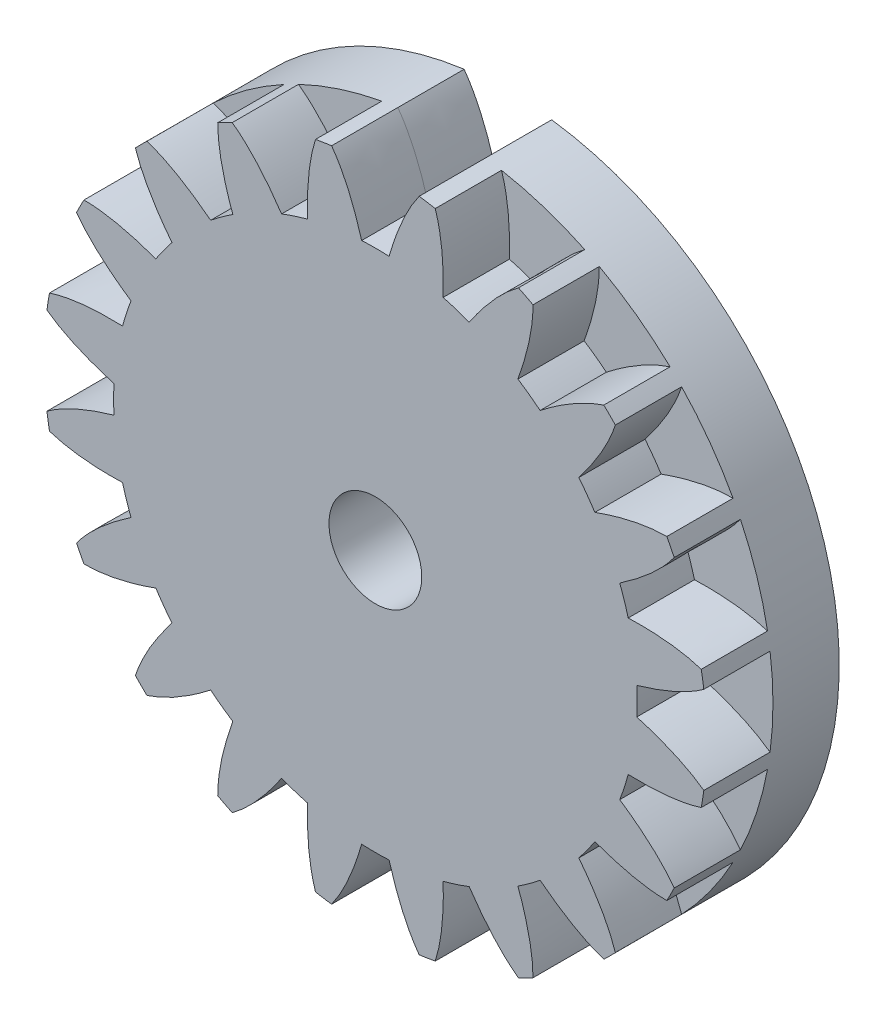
ISO-10303-21;
HEADER;
FILE_DESCRIPTION(('STEP AP214'),'2;1');
FILE_NAME('part.step','',(''),(''),'','','');
FILE_SCHEMA(('AUTOMOTIVE_DESIGN { 1 0 10303 214 1 1 1 1 }'));
ENDSEC;
DATA;
#1=APPLICATION_CONTEXT('core data for automotive mechanical design processes');
#2=APPLICATION_PROTOCOL_DEFINITION('international standard','automotive_design',2000,#1);
#3=PRODUCT_CONTEXT('',#1,'mechanical');
#4=PRODUCT('Part','Part','',(#3));
#5=PRODUCT_RELATED_PRODUCT_CATEGORY('part','',(#4));
#6=PRODUCT_DEFINITION_FORMATION('','',#4);
#7=PRODUCT_DEFINITION_CONTEXT('part definition',#1,'design');
#8=PRODUCT_DEFINITION('design','',#6,#7);
#9=PRODUCT_DEFINITION_SHAPE('','',#8);
#10=(LENGTH_UNIT() NAMED_UNIT(*) SI_UNIT(.MILLI.,.METRE.));
#11=(NAMED_UNIT(*) PLANE_ANGLE_UNIT() SI_UNIT($,.RADIAN.));
#12=(NAMED_UNIT(*) SI_UNIT($,.STERADIAN.) SOLID_ANGLE_UNIT());
#13=UNCERTAINTY_MEASURE_WITH_UNIT(LENGTH_MEASURE(1.E-05),#10,'distance_accuracy_value','');
#14=(GEOMETRIC_REPRESENTATION_CONTEXT(3) GLOBAL_UNCERTAINTY_ASSIGNED_CONTEXT((#13)) GLOBAL_UNIT_ASSIGNED_CONTEXT((#10,
#11,#12)) REPRESENTATION_CONTEXT('',''));
#15=CARTESIAN_POINT('',(0.,0.,0.));
#16=DIRECTION('',(0.,0.,1.));
#17=DIRECTION('',(1.,0.,0.));
#18=AXIS2_PLACEMENT_3D('',#15,#16,#17);
#19=CARTESIAN_POINT('',(12.4337003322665,53.9860962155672,10.));
#20=DIRECTION('',(0.,0.,1.));
#21=DIRECTION('',(1.,0.,0.));
#22=AXIS2_PLACEMENT_3D('',#19,#20,#21);
#23=PLANE('',#22);
#24=CARTESIAN_POINT('',(275880.564506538,-961150.537791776,10.));
#25=CARTESIAN_POINT('',(-271845.81673565,962391.292694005,10.));
#26=CARTESIAN_POINT('',(267860.80376609,-963416.103211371,10.));
#27=B_SPLINE_CURVE_WITH_KNOTS('',2,(#24,#25,#26),.UNSPECIFIED.,.F.,.F.,(3,3),(0.,1.),.UNSPECIFIED.);
#28=CARTESIAN_POINT('',(6.60459179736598,49.5618741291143,10.));
#29=VERTEX_POINT('',#28);
#30=CARTESIAN_POINT('',(2.06727027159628,39.4458666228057,10.));
#31=VERTEX_POINT('',#30);
#32=EDGE_CURVE('E989',#29,#31,#27,.T.);
#33=ORIENTED_EDGE('',*,*,#32,.T.);
#34=CARTESIAN_POINT('',(0.,0.,10.));
#35=DIRECTION('',(0.,0.,1.));
#36=DIRECTION('',(1.,0.,0.));
#37=AXIS2_PLACEMENT_3D('',#34,#35,#36);
#38=CIRCLE('',#37,39.5);
#39=CARTESIAN_POINT('',(-2.06727027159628,39.4458666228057,10.));
#40=VERTEX_POINT('',#39);
#41=EDGE_CURVE('E1233',#31,#40,#38,.T.);
#42=ORIENTED_EDGE('',*,*,#41,.T.);
#43=CARTESIAN_POINT('',(-267860.80376609,-963416.103211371,10.));
#44=CARTESIAN_POINT('',(271845.81673565,962391.292694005,10.));
#45=CARTESIAN_POINT('',(-275880.564506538,-961150.537791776,10.));
#46=B_SPLINE_CURVE_WITH_KNOTS('',2,(#43,#44,#45),.UNSPECIFIED.,.F.,.F.,(3,3),(0.,1.),.UNSPECIFIED.);
#47=CARTESIAN_POINT('',(-6.60459180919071,49.5618741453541,10.));
#48=VERTEX_POINT('',#47);
#49=EDGE_CURVE('E1232',#40,#48,#46,.T.);
#50=ORIENTED_EDGE('',*,*,#49,.T.);
#51=CARTESIAN_POINT('',(0.,0.,10.));
#52=DIRECTION('',(0.,0.,1.));
#53=DIRECTION('',(1.,0.,0.));
#54=AXIS2_PLACEMENT_3D('',#51,#52,#53);
#55=CIRCLE('',#54,50.);
#56=CARTESIAN_POINT('',(-9.03412131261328,49.1770744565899,10.));
#57=VERTEX_POINT('',#56);
#58=EDGE_CURVE('E1253',#48,#57,#55,.T.);
#59=ORIENTED_EDGE('',*,*,#58,.T.);
#60=CARTESIAN_POINT('',(559389.858923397,-828856.699257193,10.));
#61=CARTESIAN_POINT('',(-555936.000114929,831283.532921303,10.));
#62=CARTESIAN_POINT('',(552462.711428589,-833489.62237221,10.));
#63=B_SPLINE_CURVE_WITH_KNOTS('',2,(#60,#61,#62),.UNSPECIFIED.,.F.,.F.,(3,3),(0.,1.),.UNSPECIFIED.);
#64=CARTESIAN_POINT('',(-10.2233522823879,38.1540701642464,10.));
#65=VERTEX_POINT('',#64);
#66=EDGE_CURVE('E1847',#57,#65,#63,.T.);
#67=ORIENTED_EDGE('',*,*,#66,.T.);
#68=CARTESIAN_POINT('',(0.,0.,10.));
#69=DIRECTION('',(0.,0.,1.));
#70=DIRECTION('',(1.,0.,0.));
#71=AXIS2_PLACEMENT_3D('',#68,#69,#70);
#72=CIRCLE('',#71,39.5);
#73=CARTESIAN_POINT('',(-14.1555340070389,36.8764268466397,10.));
#74=VERTEX_POINT('',#73);
#75=EDGE_CURVE('E1843',#65,#74,#72,.T.);
#76=ORIENTED_EDGE('',*,*,#75,.T.);
#77=CARTESIAN_POINT('',(42961.1856649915,-999036.703353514,10.));
#78=CARTESIAN_POINT('',(-38854.529246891,999293.487363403,10.));
#79=CARTESIAN_POINT('',(34633.8417371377,-999360.264957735,10.));
#80=B_SPLINE_CURVE_WITH_KNOTS('',2,(#77,#78,#79),.UNSPECIFIED.,.F.,.F.,(3,3),(0.,1.),.UNSPECIFIED.);
#81=CARTESIAN_POINT('',(-21.5968014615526,45.0952122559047,10.));
#82=VERTEX_POINT('',#81);
#83=EDGE_CURVE('E1838',#74,#82,#80,.T.);
#84=ORIENTED_EDGE('',*,*,#83,.T.);
#85=CARTESIAN_POINT('',(0.,0.,10.));
#86=DIRECTION('',(0.,0.,1.));
#87=DIRECTION('',(1.,0.,0.));
#88=AXIS2_PLACEMENT_3D('',#85,#86,#87);
#89=CIRCLE('',#88,50.);
#90=CARTESIAN_POINT('',(-23.7885116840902,43.9784800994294,10.));
#91=VERTEX_POINT('',#90);
#92=EDGE_CURVE('E1825',#82,#91,#89,.T.);
#93=ORIENTED_EDGE('',*,*,#92,.T.);
#94=CARTESIAN_POINT('',(788142.176450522,-615428.592015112,10.));
#95=CARTESIAN_POINT('',(-785607.294369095,618803.949053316,10.));
#96=CARTESIAN_POINT('',(782985.719662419,-621975.370031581,10.));
#97=B_SPLINE_CURVE_WITH_KNOTS('',2,(#94,#95,#96),.UNSPECIFIED.,.F.,.F.,(3,3),(0.,1.),.UNSPECIFIED.);
#98=CARTESIAN_POINT('',(-21.5132418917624,33.1274874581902,10.));
#99=VERTEX_POINT('',#98);
#100=EDGE_CURVE('E1820',#91,#99,#97,.T.);
#101=ORIENTED_EDGE('',*,*,#100,.T.);
#102=CARTESIAN_POINT('',(0.,0.,10.));
#103=DIRECTION('',(0.,0.,1.));
#104=DIRECTION('',(1.,0.,0.));
#105=AXIS2_PLACEMENT_3D('',#102,#103,#104);
#106=CIRCLE('',#105,39.5);
#107=CARTESIAN_POINT('',(-24.8581554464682,30.6972654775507,10.));
#108=VERTEX_POINT('',#107);
#109=EDGE_CURVE('E1815',#99,#108,#106,.T.);
#110=ORIENTED_EDGE('',*,*,#109,.T.);
#111=CARTESIAN_POINT('',(349577.834915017,-936864.630273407,10.));
#112=CARTESIAN_POINT('',(-345751.523191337,938377.873002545,10.));
#113=CARTESIAN_POINT('',(341758.046243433,-939745.646437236,10.));
#114=B_SPLINE_CURVE_WITH_KNOTS('',2,(#111,#112,#113),.UNSPECIFIED.,.F.,.F.,(3,3),(0.,1.),.UNSPECIFIED.);
#115=CARTESIAN_POINT('',(-34.4749657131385,36.2143167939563,10.));
#116=VERTEX_POINT('',#115);
#117=EDGE_CURVE('E1810',#108,#116,#114,.T.);
#118=ORIENTED_EDGE('',*,*,#117,.T.);
#119=CARTESIAN_POINT('',(0.,0.,10.));
#120=DIRECTION('',(0.,0.,1.));
#121=DIRECTION('',(1.,0.,0.));
#122=AXIS2_PLACEMENT_3D('',#119,#120,#121);
#123=CIRCLE('',#122,50.);
#124=CARTESIAN_POINT('',(-36.2143167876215,34.4749656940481,10.));
#125=VERTEX_POINT('',#124);
#126=EDGE_CURVE('E1795',#116,#125,#123,.T.);
#127=ORIENTED_EDGE('',*,*,#126,.T.);
#128=CARTESIAN_POINT('',(939745.646437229,-341758.046243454,10.));
#129=CARTESIAN_POINT('',(-938377.873002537,345751.523191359,10.));
#130=CARTESIAN_POINT('',(936864.630273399,-349577.834915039,10.));
#131=B_SPLINE_CURVE_WITH_KNOTS('',2,(#128,#129,#130),.UNSPECIFIED.,.F.,.F.,(3,3),(0.,1.),.UNSPECIFIED.);
#132=CARTESIAN_POINT('',(-30.6972654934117,24.8581554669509,10.));
#133=VERTEX_POINT('',#132);
#134=EDGE_CURVE('E1790',#125,#133,#131,.T.);
#135=ORIENTED_EDGE('',*,*,#134,.T.);
#136=CARTESIAN_POINT('',(0.,0.,10.));
#137=DIRECTION('',(0.,0.,1.));
#138=DIRECTION('',(1.,0.,0.));
#139=AXIS2_PLACEMENT_3D('',#136,#137,#138);
#140=CIRCLE('',#139,39.5);
#141=CARTESIAN_POINT('',(-33.127487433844,21.513241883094,10.));
#142=VERTEX_POINT('',#141);
#143=EDGE_CURVE('E1785',#133,#142,#140,.T.);
#144=ORIENTED_EDGE('',*,*,#143,.T.);
#145=CARTESIAN_POINT('',(621975.370031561,-782985.719662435,10.));
#146=CARTESIAN_POINT('',(-618803.949053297,785607.294369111,10.));
#147=CARTESIAN_POINT('',(615428.592015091,-788142.176450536,10.));
#148=B_SPLINE_CURVE_WITH_KNOTS('',2,(#145,#146,#147),.UNSPECIFIED.,.F.,.F.,(3,3),(0.,1.),.UNSPECIFIED.);
#149=CARTESIAN_POINT('',(-43.9784801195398,23.7885116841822,10.));
#150=VERTEX_POINT('',#149);
#151=EDGE_CURVE('E1780',#142,#150,#148,.T.);
#152=ORIENTED_EDGE('',*,*,#151,.T.);
#153=CARTESIAN_POINT('',(0.,0.,10.));
#154=DIRECTION('',(0.,0.,1.));
#155=DIRECTION('',(1.,0.,0.));
#156=AXIS2_PLACEMENT_3D('',#153,#154,#155);
#157=CIRCLE('',#156,50.);
#158=CARTESIAN_POINT('',(-45.0952122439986,21.5968014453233,10.));
#159=VERTEX_POINT('',#158);
#160=EDGE_CURVE('E1765',#150,#159,#157,.T.);
#161=ORIENTED_EDGE('',*,*,#160,.T.);
#162=CARTESIAN_POINT('',(999360.264957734,-34633.8417371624,10.));
#163=CARTESIAN_POINT('',(-999293.487363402,38854.5292469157,10.));
#164=CARTESIAN_POINT('',(999036.703353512,-42961.1856650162,10.));
#165=B_SPLINE_CURVE_WITH_KNOTS('',2,(#162,#163,#164),.UNSPECIFIED.,.F.,.F.,(3,3),(0.,1.),.UNSPECIFIED.);
#166=CARTESIAN_POINT('',(-36.8764268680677,14.1555340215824,10.));
#167=VERTEX_POINT('',#166);
#168=EDGE_CURVE('E1760',#159,#167,#165,.T.);
#169=ORIENTED_EDGE('',*,*,#168,.T.);
#170=CARTESIAN_POINT('',(0.,0.,10.));
#171=DIRECTION('',(0.,0.,1.));
#172=DIRECTION('',(1.,0.,0.));
#173=AXIS2_PLACEMENT_3D('',#170,#171,#172);
#174=CIRCLE('',#173,39.5);
#175=CARTESIAN_POINT('',(-38.1540701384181,10.22335228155,10.));
#176=VERTEX_POINT('',#175);
#177=EDGE_CURVE('E1755',#167,#176,#174,.T.);
#178=ORIENTED_EDGE('',*,*,#177,.T.);
#179=CARTESIAN_POINT('',(833489.622372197,-552462.711428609,10.));
#180=CARTESIAN_POINT('',(-831283.532921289,555936.000114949,10.));
#181=CARTESIAN_POINT('',(828856.699257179,-559389.858923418,10.));
#182=B_SPLINE_CURVE_WITH_KNOTS('',2,(#179,#180,#181),.UNSPECIFIED.,.F.,.F.,(3,3),(0.,1.),.UNSPECIFIED.);
#183=CARTESIAN_POINT('',(-49.1770744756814,9.03412130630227,10.));
#184=VERTEX_POINT('',#183);
#185=EDGE_CURVE('E1750',#176,#184,#182,.T.);
#186=ORIENTED_EDGE('',*,*,#185,.T.);
#187=CARTESIAN_POINT('',(0.,0.,10.));
#188=DIRECTION('',(0.,0.,1.));
#189=DIRECTION('',(1.,0.,0.));
#190=AXIS2_PLACEMENT_3D('',#187,#188,#189);
#191=CIRCLE('',#190,50.);
#192=CARTESIAN_POINT('',(-49.5618741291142,6.6045917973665,10.));
#193=VERTEX_POINT('',#192);
#194=EDGE_CURVE('E1735',#184,#193,#191,.T.);
#195=ORIENTED_EDGE('',*,*,#194,.T.);
#196=CARTESIAN_POINT('',(961150.537791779,275880.564506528,10.));
#197=CARTESIAN_POINT('',(-962391.292694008,-271845.81673564,10.));
#198=CARTESIAN_POINT('',(963416.103211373,267860.80376608,10.));
#199=B_SPLINE_CURVE_WITH_KNOTS('',2,(#196,#197,#198),.UNSPECIFIED.,.F.,.F.,(3,3),(0.,1.),.UNSPECIFIED.);
#200=CARTESIAN_POINT('',(-39.4458666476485,2.06727027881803,10.));
#201=VERTEX_POINT('',#200);
#202=EDGE_CURVE('E1730',#193,#201,#199,.T.);
#203=ORIENTED_EDGE('',*,*,#202,.T.);
#204=CARTESIAN_POINT('',(0.,0.,10.));
#205=DIRECTION('',(0.,0.,1.));
#206=DIRECTION('',(1.,0.,0.));
#207=AXIS2_PLACEMENT_3D('',#204,#205,#206);
#208=CIRCLE('',#207,39.5);
#209=CARTESIAN_POINT('',(-39.4458666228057,-2.06727027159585,10.));
#210=VERTEX_POINT('',#209);
#211=EDGE_CURVE('E1725',#201,#210,#208,.T.);
#212=ORIENTED_EDGE('',*,*,#211,.T.);
#213=CARTESIAN_POINT('',(963416.103211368,-267860.8037661,10.));
#214=CARTESIAN_POINT('',(-962391.292694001,271845.81673566,10.));
#215=CARTESIAN_POINT('',(961150.537791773,-275880.564506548,10.));
#216=B_SPLINE_CURVE_WITH_KNOTS('',2,(#213,#214,#215),.UNSPECIFIED.,.F.,.F.,(3,3),(0.,1.),.UNSPECIFIED.);
#217=CARTESIAN_POINT('',(-49.5618741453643,-6.60459180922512,10.));
#218=VERTEX_POINT('',#217);
#219=EDGE_CURVE('E1720',#210,#218,#216,.T.);
#220=ORIENTED_EDGE('',*,*,#219,.T.);
#221=CARTESIAN_POINT('',(0.,0.,10.));
#222=DIRECTION('',(0.,0.,1.));
#223=DIRECTION('',(1.,0.,0.));
#224=AXIS2_PLACEMENT_3D('',#221,#222,#223);
#225=CIRCLE('',#224,50.);
#226=CARTESIAN_POINT('',(-49.1770744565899,-9.03412131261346,10.));
#227=VERTEX_POINT('',#226);
#228=EDGE_CURVE('E1705',#218,#227,#225,.T.);
#229=ORIENTED_EDGE('',*,*,#228,.T.);
#230=CARTESIAN_POINT('',(828856.699257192,559389.858923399,10.));
#231=CARTESIAN_POINT('',(-831283.532921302,-555936.000114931,10.));
#232=CARTESIAN_POINT('',(833489.622372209,552462.711428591,10.));
#233=B_SPLINE_CURVE_WITH_KNOTS('',2,(#230,#231,#232),.UNSPECIFIED.,.F.,.F.,(3,3),(0.,1.),.UNSPECIFIED.);
#234=CARTESIAN_POINT('',(-38.1540701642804,-10.2233522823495,10.));
#235=VERTEX_POINT('',#234);
#236=EDGE_CURVE('E1700',#227,#235,#233,.T.);
#237=ORIENTED_EDGE('',*,*,#236,.T.);
#238=CARTESIAN_POINT('',(0.,0.,10.));
#239=DIRECTION('',(0.,0.,1.));
#240=DIRECTION('',(1.,0.,0.));
#241=AXIS2_PLACEMENT_3D('',#238,#239,#240);
#242=CIRCLE('',#241,39.5);
#243=CARTESIAN_POINT('',(-36.8764268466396,-14.155534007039,10.));
#244=VERTEX_POINT('',#243);
#245=EDGE_CURVE('E1695',#235,#244,#242,.T.);
#246=ORIENTED_EDGE('',*,*,#245,.T.);
#247=CARTESIAN_POINT('',(999036.703353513,42961.1856649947,10.));
#248=CARTESIAN_POINT('',(-999293.487363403,-38854.5292468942,10.));
#249=CARTESIAN_POINT('',(999360.264957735,34633.8417371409,10.));
#250=B_SPLINE_CURVE_WITH_KNOTS('',2,(#247,#248,#249),.UNSPECIFIED.,.F.,.F.,(3,3),(0.,1.),.UNSPECIFIED.);
#251=CARTESIAN_POINT('',(-45.0952122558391,-21.5968014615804,10.));
#252=VERTEX_POINT('',#251);
#253=EDGE_CURVE('E1690',#244,#252,#250,.T.);
#254=ORIENTED_EDGE('',*,*,#253,.T.);
#255=CARTESIAN_POINT('',(0.,0.,10.));
#256=DIRECTION('',(0.,0.,1.));
#257=DIRECTION('',(1.,0.,0.));
#258=AXIS2_PLACEMENT_3D('',#255,#256,#257);
#259=CIRCLE('',#258,50.);
#260=CARTESIAN_POINT('',(-43.9784800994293,-23.7885116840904,10.));
#261=VERTEX_POINT('',#260);
#262=EDGE_CURVE('E1675',#252,#261,#259,.T.);
#263=ORIENTED_EDGE('',*,*,#262,.T.);
#264=CARTESIAN_POINT('',(615428.59201511,788142.176450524,10.));
#265=CARTESIAN_POINT('',(-618803.949053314,-785607.294369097,10.));
#266=CARTESIAN_POINT('',(621975.370031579,782985.719662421,10.));
#267=B_SPLINE_CURVE_WITH_KNOTS('',2,(#264,#265,#266),.UNSPECIFIED.,.F.,.F.,(3,3),(0.,1.),.UNSPECIFIED.);
#268=CARTESIAN_POINT('',(-33.1274874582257,-21.5132418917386,10.));
#269=VERTEX_POINT('',#268);
#270=EDGE_CURVE('E1670',#261,#269,#267,.T.);
#271=ORIENTED_EDGE('',*,*,#270,.T.);
#272=CARTESIAN_POINT('',(0.,0.,10.));
#273=DIRECTION('',(0.,0.,1.));
#274=DIRECTION('',(1.,0.,0.));
#275=AXIS2_PLACEMENT_3D('',#272,#273,#274);
#276=CIRCLE('',#275,39.5);
#277=CARTESIAN_POINT('',(-30.6972654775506,-24.8581554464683,10.));
#278=VERTEX_POINT('',#277);
#279=EDGE_CURVE('E1665',#269,#278,#276,.T.);
#280=ORIENTED_EDGE('',*,*,#279,.T.);
#281=CARTESIAN_POINT('',(936864.630273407,349577.834915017,10.));
#282=CARTESIAN_POINT('',(-938377.873002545,-345751.523191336,10.));
#283=CARTESIAN_POINT('',(939745.646437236,341758.046243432,10.));
#284=B_SPLINE_CURVE_WITH_KNOTS('',2,(#281,#282,#283),.UNSPECIFIED.,.F.,.F.,(3,3),(0.,1.),.UNSPECIFIED.);
#285=CARTESIAN_POINT('',(-36.2143167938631,-34.4749657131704,10.));
#286=VERTEX_POINT('',#285);
#287=EDGE_CURVE('E1660',#278,#286,#284,.T.);
#288=ORIENTED_EDGE('',*,*,#287,.T.);
#289=CARTESIAN_POINT('',(0.,0.,10.));
#290=DIRECTION('',(0.,0.,1.));
#291=DIRECTION('',(1.,0.,0.));
#292=AXIS2_PLACEMENT_3D('',#289,#290,#291);
#293=CIRCLE('',#292,50.);
#294=CARTESIAN_POINT('',(-34.474965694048,-36.2143167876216,10.));
#295=VERTEX_POINT('',#294);
#296=EDGE_CURVE('E1645',#286,#295,#293,.T.);
#297=ORIENTED_EDGE('',*,*,#296,.T.);
#298=CARTESIAN_POINT('',(341758.046243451,939745.646437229,10.));
#299=CARTESIAN_POINT('',(-345751.523191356,-938377.873002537,10.));
#300=CARTESIAN_POINT('',(349577.834915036,936864.6302734,10.));
#301=B_SPLINE_CURVE_WITH_KNOTS('',2,(#298,#299,#300),.UNSPECIFIED.,.F.,.F.,(3,3),(0.,1.),.UNSPECIFIED.);
#302=CARTESIAN_POINT('',(-24.8581554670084,-30.6972654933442,10.));
#303=VERTEX_POINT('',#302);
#304=EDGE_CURVE('E1640',#295,#303,#301,.T.);
#305=ORIENTED_EDGE('',*,*,#304,.T.);
#306=CARTESIAN_POINT('',(0.,0.,10.));
#307=DIRECTION('',(0.,0.,1.));
#308=DIRECTION('',(1.,0.,0.));
#309=AXIS2_PLACEMENT_3D('',#306,#307,#308);
#310=CIRCLE('',#309,39.5);
#311=CARTESIAN_POINT('',(-21.5132418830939,-33.1274874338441,10.));
#312=VERTEX_POINT('',#311);
#313=EDGE_CURVE('E1635',#303,#312,#310,.T.);
#314=ORIENTED_EDGE('',*,*,#313,.T.);
#315=CARTESIAN_POINT('',(782985.719662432,621975.370031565,10.));
#316=CARTESIAN_POINT('',(-785607.294369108,-618803.9490533,10.));
#317=CARTESIAN_POINT('',(788142.176450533,615428.592015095,10.));
#318=B_SPLINE_CURVE_WITH_KNOTS('',2,(#315,#316,#317),.UNSPECIFIED.,.F.,.F.,(3,3),(0.,1.),.UNSPECIFIED.);
#319=CARTESIAN_POINT('',(-23.7885116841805,-43.9784801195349,10.));
#320=VERTEX_POINT('',#319);
#321=EDGE_CURVE('E1630',#312,#320,#318,.T.);
#322=ORIENTED_EDGE('',*,*,#321,.T.);
#323=CARTESIAN_POINT('',(0.,0.,10.));
#324=DIRECTION('',(0.,0.,1.));
#325=DIRECTION('',(1.,0.,0.));
#326=AXIS2_PLACEMENT_3D('',#323,#324,#325);
#327=CIRCLE('',#326,50.);
#328=CARTESIAN_POINT('',(-21.5968014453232,-45.0952122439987,10.));
#329=VERTEX_POINT('',#328);
#330=EDGE_CURVE('E1615',#320,#329,#327,.T.);
#331=ORIENTED_EDGE('',*,*,#330,.T.);
#332=CARTESIAN_POINT('',(34633.8417371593,999360.264957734,10.));
#333=CARTESIAN_POINT('',(-38854.5292469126,-999293.487363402,10.));
#334=CARTESIAN_POINT('',(42961.1856650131,999036.703353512,10.));
#335=B_SPLINE_CURVE_WITH_KNOTS('',2,(#332,#333,#334),.UNSPECIFIED.,.F.,.F.,(3,3),(0.,1.),.UNSPECIFIED.);
#336=CARTESIAN_POINT('',(-14.1555340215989,-36.876426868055,10.));
#337=VERTEX_POINT('',#336);
#338=EDGE_CURVE('E1610',#329,#337,#335,.T.);
#339=ORIENTED_EDGE('',*,*,#338,.T.);
#340=CARTESIAN_POINT('',(0.,0.,10.));
#341=DIRECTION('',(0.,0.,1.));
#342=DIRECTION('',(1.,0.,0.));
#343=AXIS2_PLACEMENT_3D('',#340,#341,#342);
#344=CIRCLE('',#343,39.5);
#345=CARTESIAN_POINT('',(-10.2233522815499,-38.1540701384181,10.));
#346=VERTEX_POINT('',#345);
#347=EDGE_CURVE('E1605',#337,#346,#344,.T.);
#348=ORIENTED_EDGE('',*,*,#347,.T.);
#349=CARTESIAN_POINT('',(552462.711428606,833489.622372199,10.));
#350=CARTESIAN_POINT('',(-555936.000114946,-831283.532921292,10.));
#351=CARTESIAN_POINT('',(559389.858923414,828856.699257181,10.));
#352=B_SPLINE_CURVE_WITH_KNOTS('',2,(#349,#350,#351),.UNSPECIFIED.,.F.,.F.,(3,3),(0.,1.),.UNSPECIFIED.);
#353=CARTESIAN_POINT('',(-9.03412130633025,-49.1770744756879,10.));
#354=VERTEX_POINT('',#353);
#355=EDGE_CURVE('E1600',#346,#354,#352,.T.);
#356=ORIENTED_EDGE('',*,*,#355,.T.);
#357=CARTESIAN_POINT('',(0.,0.,10.));
#358=DIRECTION('',(0.,0.,1.));
#359=DIRECTION('',(1.,0.,0.));
#360=AXIS2_PLACEMENT_3D('',#357,#358,#359);
#361=CIRCLE('',#360,50.);
#362=CARTESIAN_POINT('',(-6.60459179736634,-49.5618741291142,10.));
#363=VERTEX_POINT('',#362);
#364=EDGE_CURVE('E1585',#354,#363,#361,.T.);
#365=ORIENTED_EDGE('',*,*,#364,.T.);
#366=CARTESIAN_POINT('',(-275880.564506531,961150.537791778,10.));
#367=CARTESIAN_POINT('',(271845.816735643,-962391.292694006,10.));
#368=CARTESIAN_POINT('',(-267860.803766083,963416.103211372,10.));
#369=B_SPLINE_CURVE_WITH_KNOTS('',2,(#366,#367,#368),.UNSPECIFIED.,.F.,.F.,(3,3),(0.,1.),.UNSPECIFIED.);
#370=CARTESIAN_POINT('',(-2.06727027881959,-39.4458666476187,10.));
#371=VERTEX_POINT('',#370);
#372=EDGE_CURVE('E1580',#363,#371,#369,.T.);
#373=ORIENTED_EDGE('',*,*,#372,.T.);
#374=CARTESIAN_POINT('',(0.,0.,10.));
#375=DIRECTION('',(0.,0.,1.));
#376=DIRECTION('',(1.,0.,0.));
#377=AXIS2_PLACEMENT_3D('',#374,#375,#376);
#378=CIRCLE('',#377,39.5);
#379=CARTESIAN_POINT('',(2.06727027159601,-39.4458666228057,10.));
#380=VERTEX_POINT('',#379);
#381=EDGE_CURVE('E1575',#371,#380,#378,.T.);
#382=ORIENTED_EDGE('',*,*,#381,.T.);
#383=CARTESIAN_POINT('',(267860.803766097,963416.103211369,10.));
#384=CARTESIAN_POINT('',(-271845.816735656,-962391.292694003,10.));
#385=CARTESIAN_POINT('',(275880.564506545,961150.537791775,10.));
#386=B_SPLINE_CURVE_WITH_KNOTS('',2,(#383,#384,#385),.UNSPECIFIED.,.F.,.F.,(3,3),(0.,1.),.UNSPECIFIED.);
#387=CARTESIAN_POINT('',(6.60459180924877,-49.5618741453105,10.));
#388=VERTEX_POINT('',#387);
#389=EDGE_CURVE('E1570',#380,#388,#386,.T.);
#390=ORIENTED_EDGE('',*,*,#389,.T.);
#391=CARTESIAN_POINT('',(0.,0.,10.));
#392=DIRECTION('',(0.,0.,1.));
#393=DIRECTION('',(1.,0.,0.));
#394=AXIS2_PLACEMENT_3D('',#391,#392,#393);
#395=CIRCLE('',#394,50.);
#396=CARTESIAN_POINT('',(9.03412131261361,-49.1770744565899,10.));
#397=VERTEX_POINT('',#396);
#398=EDGE_CURVE('E1555',#388,#397,#395,.T.);
#399=ORIENTED_EDGE('',*,*,#398,.T.);
#400=CARTESIAN_POINT('',(-559389.858923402,828856.69925719,10.));
#401=CARTESIAN_POINT('',(555936.000114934,-831283.5329213,10.));
#402=CARTESIAN_POINT('',(-552462.711428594,833489.622372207,10.));
#403=B_SPLINE_CURVE_WITH_KNOTS('',2,(#400,#401,#402),.UNSPECIFIED.,.F.,.F.,(3,3),(0.,1.),.UNSPECIFIED.);
#404=CARTESIAN_POINT('',(10.2233522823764,-38.154070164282,10.));
#405=VERTEX_POINT('',#404);
#406=EDGE_CURVE('E1550',#397,#405,#403,.T.);
#407=ORIENTED_EDGE('',*,*,#406,.T.);
#408=CARTESIAN_POINT('',(0.,0.,10.));
#409=DIRECTION('',(0.,0.,1.));
#410=DIRECTION('',(1.,0.,0.));
#411=AXIS2_PLACEMENT_3D('',#408,#409,#410);
#412=CIRCLE('',#411,39.5);
#413=CARTESIAN_POINT('',(14.1555340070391,-36.8764268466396,10.));
#414=VERTEX_POINT('',#413);
#415=EDGE_CURVE('E1545',#405,#414,#412,.T.);
#416=ORIENTED_EDGE('',*,*,#415,.T.);
#417=CARTESIAN_POINT('',(-42961.1856649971,999036.703353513,10.));
#418=CARTESIAN_POINT('',(38854.5292468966,-999293.487363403,10.));
#419=CARTESIAN_POINT('',(-34633.8417371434,999360.264957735,10.));
#420=B_SPLINE_CURVE_WITH_KNOTS('',2,(#417,#418,#419),.UNSPECIFIED.,.F.,.F.,(3,3),(0.,1.),.UNSPECIFIED.);
#421=CARTESIAN_POINT('',(21.5968014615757,-45.0952122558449,10.));
#422=VERTEX_POINT('',#421);
#423=EDGE_CURVE('E1540',#414,#422,#420,.T.);
#424=ORIENTED_EDGE('',*,*,#423,.T.);
#425=CARTESIAN_POINT('',(0.,0.,10.));
#426=DIRECTION('',(0.,0.,1.));
#427=DIRECTION('',(1.,0.,0.));
#428=AXIS2_PLACEMENT_3D('',#425,#426,#427);
#429=CIRCLE('',#428,50.);
#430=CARTESIAN_POINT('',(23.7885116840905,-43.9784800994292,10.));
#431=VERTEX_POINT('',#430);
#432=EDGE_CURVE('E1525',#422,#431,#429,.T.);
#433=ORIENTED_EDGE('',*,*,#432,.T.);
#434=CARTESIAN_POINT('',(-788142.176450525,615428.592015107,10.));
#435=CARTESIAN_POINT('',(785607.294369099,-618803.949053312,10.));
#436=CARTESIAN_POINT('',(-782985.719662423,621975.370031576,10.));
#437=B_SPLINE_CURVE_WITH_KNOTS('',2,(#434,#435,#436),.UNSPECIFIED.,.F.,.F.,(3,3),(0.,1.),.UNSPECIFIED.);
#438=CARTESIAN_POINT('',(21.5132418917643,-33.1274874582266,10.));
#439=VERTEX_POINT('',#438);
#440=EDGE_CURVE('E1520',#431,#439,#437,.T.);
#441=ORIENTED_EDGE('',*,*,#440,.T.);
#442=CARTESIAN_POINT('',(0.,0.,10.));
#443=DIRECTION('',(0.,0.,1.));
#444=DIRECTION('',(1.,0.,0.));
#445=AXIS2_PLACEMENT_3D('',#442,#443,#444);
#446=CIRCLE('',#445,39.5);
#447=CARTESIAN_POINT('',(24.8581554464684,-30.6972654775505,10.));
#448=VERTEX_POINT('',#447);
#449=EDGE_CURVE('E1515',#439,#448,#446,.T.);
#450=ORIENTED_EDGE('',*,*,#449,.T.);
#451=CARTESIAN_POINT('',(-349577.834915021,936864.630273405,10.));
#452=CARTESIAN_POINT('',(345751.523191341,-938377.873002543,10.));
#453=CARTESIAN_POINT('',(-341758.046243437,939745.646437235,10.));
#454=B_SPLINE_CURVE_WITH_KNOTS('',2,(#451,#452,#453),.UNSPECIFIED.,.F.,.F.,(3,3),(0.,1.),.UNSPECIFIED.);
#455=CARTESIAN_POINT('',(34.4749657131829,-36.2143167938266,10.));
#456=VERTEX_POINT('',#455);
#457=EDGE_CURVE('E1510',#448,#456,#454,.T.);
#458=ORIENTED_EDGE('',*,*,#457,.T.);
#459=CARTESIAN_POINT('',(0.,0.,10.));
#460=DIRECTION('',(0.,0.,1.));
#461=DIRECTION('',(1.,0.,0.));
#462=AXIS2_PLACEMENT_3D('',#459,#460,#461);
#463=CIRCLE('',#462,50.);
#464=CARTESIAN_POINT('',(36.2143167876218,-34.4749656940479,10.));
#465=VERTEX_POINT('',#464);
#466=EDGE_CURVE('E1495',#456,#465,#463,.T.);
#467=ORIENTED_EDGE('',*,*,#466,.T.);
#468=CARTESIAN_POINT('',(-939745.646437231,341758.046243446,10.));
#469=CARTESIAN_POINT('',(938377.87300254,-345751.523191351,10.));
#470=CARTESIAN_POINT('',(-936864.630273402,349577.834915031,10.));
#471=B_SPLINE_CURVE_WITH_KNOTS('',2,(#468,#469,#470),.UNSPECIFIED.,.F.,.F.,(3,3),(0.,1.),.UNSPECIFIED.);
#472=CARTESIAN_POINT('',(30.6972654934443,-24.8581554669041,10.));
#473=VERTEX_POINT('',#472);
#474=EDGE_CURVE('E1490',#465,#473,#471,.T.);
#475=ORIENTED_EDGE('',*,*,#474,.T.);
#476=CARTESIAN_POINT('',(0.,0.,10.));
#477=DIRECTION('',(0.,0.,1.));
#478=DIRECTION('',(1.,0.,0.));
#479=AXIS2_PLACEMENT_3D('',#476,#477,#478);
#480=CIRCLE('',#479,39.5);
#481=CARTESIAN_POINT('',(33.1274874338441,-21.5132418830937,10.));
#482=VERTEX_POINT('',#481);
#483=EDGE_CURVE('E1485',#473,#482,#480,.T.);
#484=ORIENTED_EDGE('',*,*,#483,.T.);
#485=CARTESIAN_POINT('',(-621975.370031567,782985.71966243,10.));
#486=CARTESIAN_POINT('',(618803.949053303,-785607.294369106,10.));
#487=CARTESIAN_POINT('',(-615428.592015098,788142.176450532,10.));
#488=B_SPLINE_CURVE_WITH_KNOTS('',2,(#485,#486,#487),.UNSPECIFIED.,.F.,.F.,(3,3),(0.,1.),.UNSPECIFIED.);
#489=CARTESIAN_POINT('',(43.9784801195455,-23.7885116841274,10.));
#490=VERTEX_POINT('',#489);
#491=EDGE_CURVE('E1480',#482,#490,#488,.T.);
#492=ORIENTED_EDGE('',*,*,#491,.T.);
#493=CARTESIAN_POINT('',(0.,0.,10.));
#494=DIRECTION('',(0.,0.,1.));
#495=DIRECTION('',(1.,0.,0.));
#496=AXIS2_PLACEMENT_3D('',#493,#494,#495);
#497=CIRCLE('',#496,50.);
#498=CARTESIAN_POINT('',(45.0952122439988,-21.596801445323,10.));
#499=VERTEX_POINT('',#498);
#500=EDGE_CURVE('E1465',#490,#499,#497,.T.);
#501=ORIENTED_EDGE('',*,*,#500,.T.);
#502=CARTESIAN_POINT('',(-999360.264957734,34633.8417371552,10.));
#503=CARTESIAN_POINT('',(999293.487363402,-38854.5292469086,10.));
#504=CARTESIAN_POINT('',(-999036.703353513,42961.185665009,10.));
#505=B_SPLINE_CURVE_WITH_KNOTS('',2,(#502,#503,#504),.UNSPECIFIED.,.F.,.F.,(3,3),(0.,1.),.UNSPECIFIED.);
#506=CARTESIAN_POINT('',(36.8764268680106,-14.155534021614,10.));
#507=VERTEX_POINT('',#506);
#508=EDGE_CURVE('E1460',#499,#507,#505,.T.);
#509=ORIENTED_EDGE('',*,*,#508,.T.);
#510=CARTESIAN_POINT('',(0.,0.,10.));
#511=DIRECTION('',(0.,0.,1.));
#512=DIRECTION('',(1.,0.,0.));
#513=AXIS2_PLACEMENT_3D('',#510,#511,#512);
#514=CIRCLE('',#513,39.5);
#515=CARTESIAN_POINT('',(38.1540701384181,-10.2233522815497,10.));
#516=VERTEX_POINT('',#515);
#517=EDGE_CURVE('E1455',#507,#516,#514,.T.);
#518=ORIENTED_EDGE('',*,*,#517,.T.);
#519=CARTESIAN_POINT('',(-833489.622372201,552462.711428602,10.));
#520=CARTESIAN_POINT('',(831283.532921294,-555936.000114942,10.));
#521=CARTESIAN_POINT('',(-828856.699257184,559389.858923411,10.));
#522=B_SPLINE_CURVE_WITH_KNOTS('',2,(#519,#520,#521),.UNSPECIFIED.,.F.,.F.,(3,3),(0.,1.),.UNSPECIFIED.);
#523=CARTESIAN_POINT('',(49.1770744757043,-9.03412130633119,10.));
#524=VERTEX_POINT('',#523);
#525=EDGE_CURVE('E1450',#516,#524,#522,.T.);
#526=ORIENTED_EDGE('',*,*,#525,.T.);
#527=CARTESIAN_POINT('',(0.,0.,10.));
#528=DIRECTION('',(0.,0.,1.));
#529=DIRECTION('',(1.,0.,0.));
#530=AXIS2_PLACEMENT_3D('',#527,#528,#529);
#531=CIRCLE('',#530,50.);
#532=CARTESIAN_POINT('',(49.5618741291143,-6.60459179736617,10.));
#533=VERTEX_POINT('',#532);
#534=EDGE_CURVE('E1435',#524,#533,#531,.T.);
#535=ORIENTED_EDGE('',*,*,#534,.T.);
#536=CARTESIAN_POINT('',(-961150.537791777,-275880.564506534,10.));
#537=CARTESIAN_POINT('',(962391.292694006,271845.816735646,10.));
#538=CARTESIAN_POINT('',(-963416.103211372,-267860.803766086,10.));
#539=B_SPLINE_CURVE_WITH_KNOTS('',2,(#536,#537,#538),.UNSPECIFIED.,.F.,.F.,(3,3),(0.,1.),.UNSPECIFIED.);
#540=CARTESIAN_POINT('',(39.4458666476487,-2.06727027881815,10.));
#541=VERTEX_POINT('',#540);
#542=EDGE_CURVE('E1430',#533,#541,#539,.T.);
#543=ORIENTED_EDGE('',*,*,#542,.T.);
#544=CARTESIAN_POINT('',(0.,0.,10.));
#545=DIRECTION('',(0.,0.,1.));
#546=DIRECTION('',(1.,0.,0.));
#547=AXIS2_PLACEMENT_3D('',#544,#545,#546);
#548=CIRCLE('',#547,39.5);
#549=CARTESIAN_POINT('',(39.4458666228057,2.06727027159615,10.));
#550=VERTEX_POINT('',#549);
#551=EDGE_CURVE('E1425',#541,#550,#548,.T.);
#552=ORIENTED_EDGE('',*,*,#551,.T.);
#553=CARTESIAN_POINT('',(-963416.103211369,267860.803766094,10.));
#554=CARTESIAN_POINT('',(962391.292694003,-271845.816735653,10.));
#555=CARTESIAN_POINT('',(-961150.537791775,275880.564506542,10.));
#556=B_SPLINE_CURVE_WITH_KNOTS('',2,(#553,#554,#555),.UNSPECIFIED.,.F.,.F.,(3,3),(0.,1.),.UNSPECIFIED.);
#557=CARTESIAN_POINT('',(49.5618741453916,6.60459180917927,10.));
#558=VERTEX_POINT('',#557);
#559=EDGE_CURVE('E1420',#550,#558,#556,.T.);
#560=ORIENTED_EDGE('',*,*,#559,.T.);
#561=CARTESIAN_POINT('',(0.,0.,10.));
#562=DIRECTION('',(0.,0.,1.));
#563=DIRECTION('',(1.,0.,0.));
#564=AXIS2_PLACEMENT_3D('',#561,#562,#563);
#565=CIRCLE('',#564,50.);
#566=CARTESIAN_POINT('',(49.1770744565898,9.03412131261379,10.));
#567=VERTEX_POINT('',#566);
#568=EDGE_CURVE('E1405',#558,#567,#565,.T.);
#569=ORIENTED_EDGE('',*,*,#568,.T.);
#570=CARTESIAN_POINT('',(-828856.699257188,-559389.858923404,10.));
#571=CARTESIAN_POINT('',(831283.532921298,555936.000114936,10.));
#572=CARTESIAN_POINT('',(-833489.622372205,-552462.711428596,10.));
#573=B_SPLINE_CURVE_WITH_KNOTS('',2,(#570,#571,#572),.UNSPECIFIED.,.F.,.F.,(3,3),(0.,1.),.UNSPECIFIED.);
#574=CARTESIAN_POINT('',(38.1540701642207,10.2233522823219,10.));
#575=VERTEX_POINT('',#574);
#576=EDGE_CURVE('E1400',#567,#575,#573,.T.);
#577=ORIENTED_EDGE('',*,*,#576,.T.);
#578=CARTESIAN_POINT('',(0.,0.,10.));
#579=DIRECTION('',(0.,0.,1.));
#580=DIRECTION('',(1.,0.,0.));
#581=AXIS2_PLACEMENT_3D('',#578,#579,#580);
#582=CIRCLE('',#581,39.5);
#583=CARTESIAN_POINT('',(36.8764268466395,14.1555340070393,10.));
#584=VERTEX_POINT('',#583);
#585=EDGE_CURVE('E1395',#575,#584,#582,.T.);
#586=ORIENTED_EDGE('',*,*,#585,.T.);
#587=CARTESIAN_POINT('',(-999036.703353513,-42961.1856650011,10.));
#588=CARTESIAN_POINT('',(999293.487363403,38854.5292469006,10.));
#589=CARTESIAN_POINT('',(-999360.264957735,-34633.8417371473,10.));
#590=B_SPLINE_CURVE_WITH_KNOTS('',2,(#587,#588,#589),.UNSPECIFIED.,.F.,.F.,(3,3),(0.,1.),.UNSPECIFIED.);
#591=CARTESIAN_POINT('',(45.0952122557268,21.5968014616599,10.));
#592=VERTEX_POINT('',#591);
#593=EDGE_CURVE('E1390',#584,#592,#590,.T.);
#594=ORIENTED_EDGE('',*,*,#593,.T.);
#595=CARTESIAN_POINT('',(0.,0.,10.));
#596=DIRECTION('',(0.,0.,1.));
#597=DIRECTION('',(1.,0.,0.));
#598=AXIS2_PLACEMENT_3D('',#595,#596,#597);
#599=CIRCLE('',#598,50.);
#600=CARTESIAN_POINT('',(43.9784800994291,23.7885116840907,10.));
#601=VERTEX_POINT('',#600);
#602=EDGE_CURVE('E1375',#592,#601,#599,.T.);
#603=ORIENTED_EDGE('',*,*,#602,.T.);
#604=CARTESIAN_POINT('',(-615428.592015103,-788142.176450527,10.));
#605=CARTESIAN_POINT('',(618803.949053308,785607.294369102,10.));
#606=CARTESIAN_POINT('',(-621975.370031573,-782985.719662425,10.));
#607=B_SPLINE_CURVE_WITH_KNOTS('',2,(#604,#605,#606),.UNSPECIFIED.,.F.,.F.,(3,3),(0.,1.),.UNSPECIFIED.);
#608=CARTESIAN_POINT('',(33.1274874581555,21.5132418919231,10.));
#609=VERTEX_POINT('',#608);
#610=EDGE_CURVE('E1370',#601,#609,#607,.T.);
#611=ORIENTED_EDGE('',*,*,#610,.T.);
#612=CARTESIAN_POINT('',(0.,0.,10.));
#613=DIRECTION('',(0.,0.,1.));
#614=DIRECTION('',(1.,0.,0.));
#615=AXIS2_PLACEMENT_3D('',#612,#613,#614);
#616=CIRCLE('',#615,39.5);
#617=CARTESIAN_POINT('',(30.6972654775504,24.8581554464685,10.));
#618=VERTEX_POINT('',#617);
#619=EDGE_CURVE('E1365',#609,#618,#616,.T.);
#620=ORIENTED_EDGE('',*,*,#619,.T.);
#621=CARTESIAN_POINT('',(-936864.630273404,-349577.834915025,10.));
#622=CARTESIAN_POINT('',(938377.873002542,345751.523191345,10.));
#623=CARTESIAN_POINT('',(-939745.646437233,-341758.04624344,10.));
#624=B_SPLINE_CURVE_WITH_KNOTS('',2,(#621,#622,#623),.UNSPECIFIED.,.F.,.F.,(3,3),(0.,1.),.UNSPECIFIED.);
#625=CARTESIAN_POINT('',(36.214316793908,34.4749657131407,10.));
#626=VERTEX_POINT('',#625);
#627=EDGE_CURVE('E1360',#618,#626,#624,.T.);
#628=ORIENTED_EDGE('',*,*,#627,.T.);
#629=CARTESIAN_POINT('',(0.,0.,10.));
#630=DIRECTION('',(0.,0.,1.));
#631=DIRECTION('',(1.,0.,0.));
#632=AXIS2_PLACEMENT_3D('',#629,#630,#631);
#633=CIRCLE('',#632,50.);
#634=CARTESIAN_POINT('',(34.4749656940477,36.2143167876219,10.));
#635=VERTEX_POINT('',#634);
#636=EDGE_CURVE('E1345',#626,#635,#633,.T.);
#637=ORIENTED_EDGE('',*,*,#636,.T.);
#638=CARTESIAN_POINT('',(-341758.046243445,-939745.646437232,10.));
#639=CARTESIAN_POINT('',(345751.523191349,938377.87300254,10.));
#640=CARTESIAN_POINT('',(-349577.834915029,-936864.630273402,10.));
#641=B_SPLINE_CURVE_WITH_KNOTS('',2,(#638,#639,#640),.UNSPECIFIED.,.F.,.F.,(3,3),(0.,1.),.UNSPECIFIED.);
#642=CARTESIAN_POINT('',(24.8581554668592,30.6972654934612,10.));
#643=VERTEX_POINT('',#642);
#644=EDGE_CURVE('E1340',#635,#643,#641,.T.);
#645=ORIENTED_EDGE('',*,*,#644,.T.);
#646=CARTESIAN_POINT('',(0.,0.,10.));
#647=DIRECTION('',(0.,0.,1.));
#648=DIRECTION('',(1.,0.,0.));
#649=AXIS2_PLACEMENT_3D('',#646,#647,#648);
#650=CIRCLE('',#649,39.5);
#651=CARTESIAN_POINT('',(21.5132418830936,33.1274874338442,10.));
#652=VERTEX_POINT('',#651);
#653=EDGE_CURVE('E1335',#643,#652,#650,.T.);
#654=ORIENTED_EDGE('',*,*,#653,.T.);
#655=CARTESIAN_POINT('',(-782985.719662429,-621975.370031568,10.));
#656=CARTESIAN_POINT('',(785607.294369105,618803.949053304,10.));
#657=CARTESIAN_POINT('',(-788142.176450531,-615428.592015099,10.));
#658=B_SPLINE_CURVE_WITH_KNOTS('',2,(#655,#656,#657),.UNSPECIFIED.,.F.,.F.,(3,3),(0.,1.),.UNSPECIFIED.);
#659=CARTESIAN_POINT('',(23.7885116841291,43.978480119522,10.));
#660=VERTEX_POINT('',#659);
#661=EDGE_CURVE('E1314',#652,#660,#658,.T.);
#662=ORIENTED_EDGE('',*,*,#661,.T.);
#663=CARTESIAN_POINT('',(0.,0.,10.));
#664=DIRECTION('',(0.,0.,1.));
#665=DIRECTION('',(1.,0.,0.));
#666=AXIS2_PLACEMENT_3D('',#663,#664,#665);
#667=CIRCLE('',#666,50.);
#668=CARTESIAN_POINT('',(21.5968014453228,45.0952122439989,10.));
#669=VERTEX_POINT('',#668);
#670=EDGE_CURVE('E1313',#660,#669,#667,.T.);
#671=ORIENTED_EDGE('',*,*,#670,.T.);
#672=CARTESIAN_POINT('',(-34633.8417371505,-999360.264957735,10.));
#673=CARTESIAN_POINT('',(38854.5292469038,999293.487363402,10.));
#674=CARTESIAN_POINT('',(-42961.1856650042,-999036.703353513,10.));
#675=B_SPLINE_CURVE_WITH_KNOTS('',2,(#672,#673,#674),.UNSPECIFIED.,.F.,.F.,(3,3),(0.,1.),.UNSPECIFIED.);
#676=CARTESIAN_POINT('',(14.1555340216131,36.8764268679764,10.));
#677=VERTEX_POINT('',#676);
#678=EDGE_CURVE('E1312',#669,#677,#675,.T.);
#679=ORIENTED_EDGE('',*,*,#678,.T.);
#680=CARTESIAN_POINT('',(0.,0.,10.));
#681=DIRECTION('',(0.,0.,1.));
#682=DIRECTION('',(1.,0.,0.));
#683=AXIS2_PLACEMENT_3D('',#680,#681,#682);
#684=CIRCLE('',#683,39.5);
#685=CARTESIAN_POINT('',(10.2233522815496,38.1540701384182,10.));
#686=VERTEX_POINT('',#685);
#687=EDGE_CURVE('E608',#677,#686,#684,.T.);
#688=ORIENTED_EDGE('',*,*,#687,.T.);
#689=CARTESIAN_POINT('',(-552462.7114286,-833489.622372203,10.));
#690=CARTESIAN_POINT('',(555936.00011494,831283.532921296,10.));
#691=CARTESIAN_POINT('',(-559389.858923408,-828856.699257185,10.));
#692=B_SPLINE_CURVE_WITH_KNOTS('',2,(#689,#690,#691),.UNSPECIFIED.,.F.,.F.,(3,3),(0.,1.),.UNSPECIFIED.);
#693=CARTESIAN_POINT('',(9.034121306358,49.1770744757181,10.));
#694=VERTEX_POINT('',#693);
#695=EDGE_CURVE('E602',#686,#694,#692,.T.);
#696=ORIENTED_EDGE('',*,*,#695,.T.);
#697=CARTESIAN_POINT('',(0.,0.,10.));
#698=DIRECTION('',(0.,0.,1.));
#699=DIRECTION('',(1.,0.,0.));
#700=AXIS2_PLACEMENT_3D('',#697,#698,#699);
#701=CIRCLE('',#700,50.);
#702=EDGE_CURVE('E50',#694,#29,#701,.T.);
#703=ORIENTED_EDGE('',*,*,#702,.T.);
#704=EDGE_LOOP('',(#33,#42,#50,#59,#67,#76,#84,#93,#101,#110,#118,#127,#135,#144,#152,#161,#169,
#178,#186,#195,#203,#212,#220,#229,#237,#246,#254,#263,#271,#280,#288,#297,#305,#314,#322,#331,
#339,#348,#356,#365,#373,#382,#390,#399,#407,#416,#424,#433,#441,#450,#458,#467,#475,#484,#492,
#501,#509,#518,#526,#535,#543,#552,#560,#569,#577,#586,#594,#603,#611,#620,#628,#637,#645,#654,
#662,#671,#679,#688,#696,#703));
#705=FACE_BOUND('',#704,.T.);
#706=CARTESIAN_POINT('',(0.,0.,10.));
#707=DIRECTION('',(0.,0.,1.));
#708=DIRECTION('',(1.,0.,0.));
#709=AXIS2_PLACEMENT_3D('',#706,#707,#708);
#710=CIRCLE('',#709,7.);
#711=CARTESIAN_POINT('',(7.,0.,10.));
#712=VERTEX_POINT('',#711);
#713=EDGE_CURVE('E620',#712,#712,#710,.T.);
#714=ORIENTED_EDGE('',*,*,#713,.F.);
#715=EDGE_LOOP('',(#714));
#716=FACE_BOUND('',#715,.T.);
#717=ADVANCED_FACE('F33',(#705,#716),#23,.T.);
#718=DIRECTION('',(0.,0.,-1.));
#719=VECTOR('',#718,1.);
#720=SURFACE_OF_LINEAR_EXTRUSION('',#27,#719);
#721=CARTESIAN_POINT('',(275880.564506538,-961150.537791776,0.));
#722=CARTESIAN_POINT('',(-271845.81673565,962391.292694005,0.));
#723=CARTESIAN_POINT('',(267860.80376609,-963416.103211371,0.));
#724=B_SPLINE_CURVE_WITH_KNOTS('',2,(#721,#722,#723),.UNSPECIFIED.,.F.,.F.,(3,3),(0.,1.),.UNSPECIFIED.);
#725=CARTESIAN_POINT('',(6.60459179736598,49.5618741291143,0.));
#726=VERTEX_POINT('',#725);
#727=CARTESIAN_POINT('',(2.06727027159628,39.4458666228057,0.));
#728=VERTEX_POINT('',#727);
#729=EDGE_CURVE('E615',#726,#728,#724,.T.);
#730=ORIENTED_EDGE('',*,*,#729,.T.);
#731=DIRECTION('',(0.,0.,-1.));
#732=VECTOR('',#731,1.);
#733=CARTESIAN_POINT('',(2.06727027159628,39.4458666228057,10.));
#734=LINE('',#733,#732);
#735=EDGE_CURVE('E11',#31,#728,#734,.T.);
#736=ORIENTED_EDGE('',*,*,#735,.F.);
#737=ORIENTED_EDGE('',*,*,#32,.F.);
#738=DIRECTION('',(0.,0.,-1.));
#739=VECTOR('',#738,1.);
#740=CARTESIAN_POINT('',(6.60459179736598,49.5618741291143,10.));
#741=LINE('',#740,#739);
#742=EDGE_CURVE('E614',#29,#726,#741,.T.);
#743=ORIENTED_EDGE('',*,*,#742,.T.);
#744=EDGE_LOOP('',(#730,#736,#737,#743));
#745=FACE_BOUND('',#744,.T.);
#746=ADVANCED_FACE('F35',(#745),#720,.F.);
#747=CARTESIAN_POINT('',(0.,0.,10.));
#748=DIRECTION('',(0.,0.,-1.));
#749=DIRECTION('',(-1.,0.,0.));
#750=AXIS2_PLACEMENT_3D('',#747,#748,#749);
#751=CYLINDRICAL_SURFACE('',#750,39.5);
#752=ORIENTED_EDGE('',*,*,#735,.T.);
#753=DIRECTION('',(0.,0.,1.));
#754=VECTOR('',#753,1.);
#755=CARTESIAN_POINT('',(2.06727027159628,39.4458666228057,-10.));
#756=LINE('',#755,#754);
#757=CARTESIAN_POINT('',(2.06727027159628,39.4458666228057,-10.));
#758=VERTEX_POINT('',#757);
#759=EDGE_CURVE('E538',#758,#728,#756,.T.);
#760=ORIENTED_EDGE('',*,*,#759,.F.);
#761=CARTESIAN_POINT('',(0.,0.,-10.));
#762=DIRECTION('',(0.,0.,1.));
#763=DIRECTION('',(1.,0.,0.));
#764=AXIS2_PLACEMENT_3D('',#761,#762,#763);
#765=CIRCLE('',#764,39.5);
#766=CARTESIAN_POINT('',(-2.06727027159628,39.4458666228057,-10.));
#767=VERTEX_POINT('',#766);
#768=EDGE_CURVE('E541',#758,#767,#765,.T.);
#769=ORIENTED_EDGE('',*,*,#768,.T.);
#770=DIRECTION('',(0.,0.,1.));
#771=VECTOR('',#770,1.);
#772=CARTESIAN_POINT('',(-2.06727027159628,39.4458666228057,-10.));
#773=LINE('',#772,#771);
#774=CARTESIAN_POINT('',(-2.06727027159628,39.4458666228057,0.));
#775=VERTEX_POINT('',#774);
#776=EDGE_CURVE('E547',#767,#775,#773,.T.);
#777=ORIENTED_EDGE('',*,*,#776,.T.);
#778=DIRECTION('',(0.,0.,-1.));
#779=VECTOR('',#778,1.);
#780=CARTESIAN_POINT('',(-2.06727027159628,39.4458666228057,10.));
#781=LINE('',#780,#779);
#782=EDGE_CURVE('E43',#40,#775,#781,.T.);
#783=ORIENTED_EDGE('',*,*,#782,.F.);
#784=ORIENTED_EDGE('',*,*,#41,.F.);
#785=EDGE_LOOP('',(#752,#760,#769,#777,#783,#784));
#786=FACE_BOUND('',#785,.T.);
#787=ADVANCED_FACE('F540',(#786),#751,.T.);
#788=DIRECTION('',(0.,0.,-1.));
#789=VECTOR('',#788,1.);
#790=SURFACE_OF_LINEAR_EXTRUSION('',#46,#789);
#791=CARTESIAN_POINT('',(-267860.80376609,-963416.103211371,0.));
#792=CARTESIAN_POINT('',(271845.81673565,962391.292694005,0.));
#793=CARTESIAN_POINT('',(-275880.564506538,-961150.537791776,0.));
#794=B_SPLINE_CURVE_WITH_KNOTS('',2,(#791,#792,#793),.UNSPECIFIED.,.F.,.F.,(3,3),(0.,1.),.UNSPECIFIED.);
#795=CARTESIAN_POINT('',(-6.60459182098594,49.5618741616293,0.));
#796=VERTEX_POINT('',#795);
#797=EDGE_CURVE('E619',#775,#796,#794,.T.);
#798=ORIENTED_EDGE('',*,*,#797,.T.);
#799=DIRECTION('',(0.,0.,-1.));
#800=VECTOR('',#799,1.);
#801=CARTESIAN_POINT('',(-6.60459180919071,49.5618741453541,10.));
#802=LINE('',#801,#800);
#803=EDGE_CURVE('E1223',#48,#796,#802,.T.);
#804=ORIENTED_EDGE('',*,*,#803,.F.);
#805=ORIENTED_EDGE('',*,*,#49,.F.);
#806=ORIENTED_EDGE('',*,*,#782,.T.);
#807=EDGE_LOOP('',(#798,#804,#805,#806));
#808=FACE_BOUND('',#807,.T.);
#809=ADVANCED_FACE('F1229',(#808),#790,.F.);
#810=DIRECTION('',(0.,0.,-1.));
#811=VECTOR('',#810,1.);
#812=SURFACE_OF_LINEAR_EXTRUSION('',#63,#811);
#813=CARTESIAN_POINT('',(559389.858923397,-828856.699257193,0.));
#814=CARTESIAN_POINT('',(-555936.000114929,831283.532921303,0.));
#815=CARTESIAN_POINT('',(552462.711428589,-833489.62237221,0.));
#816=B_SPLINE_CURVE_WITH_KNOTS('',2,(#813,#814,#815),.UNSPECIFIED.,.F.,.F.,(3,3),(0.,1.),.UNSPECIFIED.);
#817=CARTESIAN_POINT('',(-9.03412130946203,49.1770744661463,0.));
#818=VERTEX_POINT('',#817);
#819=CARTESIAN_POINT('',(-10.2233522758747,38.1540701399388,0.));
#820=VERTEX_POINT('',#819);
#821=EDGE_CURVE('E628',#818,#820,#816,.T.);
#822=ORIENTED_EDGE('',*,*,#821,.T.);
#823=DIRECTION('',(0.,0.,-1.));
#824=VECTOR('',#823,1.);
#825=CARTESIAN_POINT('',(-10.2233522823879,38.1540701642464,10.));
#826=LINE('',#825,#824);
#827=EDGE_CURVE('E1217',#65,#820,#826,.T.);
#828=ORIENTED_EDGE('',*,*,#827,.F.);
#829=ORIENTED_EDGE('',*,*,#66,.F.);
#830=DIRECTION('',(0.,0.,-1.));
#831=VECTOR('',#830,1.);
#832=CARTESIAN_POINT('',(-9.03412131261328,49.1770744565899,10.));
#833=LINE('',#832,#831);
#834=EDGE_CURVE('E1220',#57,#818,#833,.T.);
#835=ORIENTED_EDGE('',*,*,#834,.T.);
#836=EDGE_LOOP('',(#822,#828,#829,#835));
#837=FACE_BOUND('',#836,.T.);
#838=ADVANCED_FACE('F1261',(#837),#812,.F.);
#839=CARTESIAN_POINT('',(0.,0.,10.));
#840=DIRECTION('',(0.,0.,-1.));
#841=DIRECTION('',(-1.,0.,0.));
#842=AXIS2_PLACEMENT_3D('',#839,#840,#841);
#843=CYLINDRICAL_SURFACE('',#842,39.5);
#844=CARTESIAN_POINT('',(0.,0.,0.));
#845=DIRECTION('',(0.,0.,1.));
#846=DIRECTION('',(1.,0.,0.));
#847=AXIS2_PLACEMENT_3D('',#844,#845,#846);
#848=CIRCLE('',#847,39.5);
#849=CARTESIAN_POINT('',(-14.1555340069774,36.876426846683,0.));
#850=VERTEX_POINT('',#849);
#851=EDGE_CURVE('E636',#820,#850,#848,.T.);
#852=ORIENTED_EDGE('',*,*,#851,.T.);
#853=DIRECTION('',(0.,0.,-1.));
#854=VECTOR('',#853,1.);
#855=CARTESIAN_POINT('',(-14.1555340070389,36.8764268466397,10.));
#856=LINE('',#855,#854);
#857=EDGE_CURVE('E1214',#74,#850,#856,.T.);
#858=ORIENTED_EDGE('',*,*,#857,.F.);
#859=ORIENTED_EDGE('',*,*,#75,.F.);
#860=ORIENTED_EDGE('',*,*,#827,.T.);
#861=EDGE_LOOP('',(#852,#858,#859,#860));
#862=FACE_BOUND('',#861,.T.);
#863=ADVANCED_FACE('F1836',(#862),#843,.T.);
#864=DIRECTION('',(0.,0.,-1.));
#865=VECTOR('',#864,1.);
#866=SURFACE_OF_LINEAR_EXTRUSION('',#80,#865);
#867=CARTESIAN_POINT('',(42961.1856649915,-999036.703353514,0.));
#868=CARTESIAN_POINT('',(-38854.529246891,999293.487363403,0.));
#869=CARTESIAN_POINT('',(34633.8417371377,-999360.264957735,0.));
#870=B_SPLINE_CURVE_WITH_KNOTS('',2,(#867,#868,#869),.UNSPECIFIED.,.F.,.F.,(3,3),(0.,1.),.UNSPECIFIED.);
#871=CARTESIAN_POINT('',(-21.5968014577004,45.0952122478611,0.));
#872=VERTEX_POINT('',#871);
#873=EDGE_CURVE('E642',#850,#872,#870,.T.);
#874=ORIENTED_EDGE('',*,*,#873,.T.);
#875=DIRECTION('',(0.,0.,-1.));
#876=VECTOR('',#875,1.);
#877=CARTESIAN_POINT('',(-21.5968014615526,45.0952122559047,10.));
#878=LINE('',#877,#876);
#879=EDGE_CURVE('E1211',#82,#872,#878,.T.);
#880=ORIENTED_EDGE('',*,*,#879,.F.);
#881=ORIENTED_EDGE('',*,*,#83,.F.);
#882=ORIENTED_EDGE('',*,*,#857,.T.);
#883=EDGE_LOOP('',(#874,#880,#881,#882));
#884=FACE_BOUND('',#883,.T.);
#885=ADVANCED_FACE('F1833',(#884),#866,.F.);
#886=DIRECTION('',(0.,0.,-1.));
#887=VECTOR('',#886,1.);
#888=SURFACE_OF_LINEAR_EXTRUSION('',#97,#887);
#889=CARTESIAN_POINT('',(788142.176450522,-615428.592015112,0.));
#890=CARTESIAN_POINT('',(-785607.294369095,618803.949053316,0.));
#891=CARTESIAN_POINT('',(782985.719662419,-621975.370031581,0.));
#892=B_SPLINE_CURVE_WITH_KNOTS('',2,(#889,#890,#891),.UNSPECIFIED.,.F.,.F.,(3,3),(0.,1.),.UNSPECIFIED.);
#893=CARTESIAN_POINT('',(-23.788511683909,43.9784801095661,0.));
#894=VERTEX_POINT('',#893);
#895=CARTESIAN_POINT('',(-21.5132418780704,33.1274874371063,0.));
#896=VERTEX_POINT('',#895);
#897=EDGE_CURVE('E647',#894,#896,#892,.T.);
#898=ORIENTED_EDGE('',*,*,#897,.T.);
#899=DIRECTION('',(0.,0.,-1.));
#900=VECTOR('',#899,1.);
#901=CARTESIAN_POINT('',(-21.5132418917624,33.1274874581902,10.));
#902=LINE('',#901,#900);
#903=EDGE_CURVE('E1205',#99,#896,#902,.T.);
#904=ORIENTED_EDGE('',*,*,#903,.F.);
#905=ORIENTED_EDGE('',*,*,#100,.F.);
#906=DIRECTION('',(0.,0.,-1.));
#907=VECTOR('',#906,1.);
#908=CARTESIAN_POINT('',(-23.7885116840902,43.9784800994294,10.));
#909=LINE('',#908,#907);
#910=EDGE_CURVE('E1208',#91,#894,#909,.T.);
#911=ORIENTED_EDGE('',*,*,#910,.T.);
#912=EDGE_LOOP('',(#898,#904,#905,#911));
#913=FACE_BOUND('',#912,.T.);
#914=ADVANCED_FACE('F1830',(#913),#888,.F.);
#915=CARTESIAN_POINT('',(0.,0.,10.));
#916=DIRECTION('',(0.,0.,-1.));
#917=DIRECTION('',(-1.,0.,0.));
#918=AXIS2_PLACEMENT_3D('',#915,#916,#917);
#919=CYLINDRICAL_SURFACE('',#918,39.5);
#920=CARTESIAN_POINT('',(0.,0.,0.));
#921=DIRECTION('',(0.,0.,1.));
#922=DIRECTION('',(1.,0.,0.));
#923=AXIS2_PLACEMENT_3D('',#920,#921,#922);
#924=CIRCLE('',#923,39.5);
#925=CARTESIAN_POINT('',(-24.8581554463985,30.6972654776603,0.));
#926=VERTEX_POINT('',#925);
#927=EDGE_CURVE('E655',#896,#926,#924,.T.);
#928=ORIENTED_EDGE('',*,*,#927,.T.);
#929=DIRECTION('',(0.,0.,-1.));
#930=VECTOR('',#929,1.);
#931=CARTESIAN_POINT('',(-24.8581554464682,30.6972654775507,10.));
#932=LINE('',#931,#930);
#933=EDGE_CURVE('E1202',#108,#926,#932,.T.);
#934=ORIENTED_EDGE('',*,*,#933,.F.);
#935=ORIENTED_EDGE('',*,*,#109,.F.);
#936=ORIENTED_EDGE('',*,*,#903,.T.);
#937=EDGE_LOOP('',(#928,#934,#935,#936));
#938=FACE_BOUND('',#937,.T.);
#939=ADVANCED_FACE('F1807',(#938),#919,.T.);
#940=DIRECTION('',(0.,0.,-1.));
#941=VECTOR('',#940,1.);
#942=SURFACE_OF_LINEAR_EXTRUSION('',#114,#941);
#943=CARTESIAN_POINT('',(349577.834915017,-936864.630273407,0.));
#944=CARTESIAN_POINT('',(-345751.523191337,938377.873002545,0.));
#945=CARTESIAN_POINT('',(341758.046243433,-939745.646437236,0.));
#946=B_SPLINE_CURVE_WITH_KNOTS('',2,(#943,#944,#945),.UNSPECIFIED.,.F.,.F.,(3,3),(0.,1.),.UNSPECIFIED.);
#947=CARTESIAN_POINT('',(-34.4749657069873,36.2143167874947,0.));
#948=VERTEX_POINT('',#947);
#949=EDGE_CURVE('E661',#926,#948,#946,.T.);
#950=ORIENTED_EDGE('',*,*,#949,.T.);
#951=DIRECTION('',(0.,0.,-1.));
#952=VECTOR('',#951,1.);
#953=CARTESIAN_POINT('',(-34.4749657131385,36.2143167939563,10.));
#954=LINE('',#953,#952);
#955=EDGE_CURVE('E1199',#116,#948,#954,.T.);
#956=ORIENTED_EDGE('',*,*,#955,.F.);
#957=ORIENTED_EDGE('',*,*,#117,.F.);
#958=ORIENTED_EDGE('',*,*,#933,.T.);
#959=EDGE_LOOP('',(#950,#956,#957,#958));
#960=FACE_BOUND('',#959,.T.);
#961=ADVANCED_FACE('F1803',(#960),#942,.F.);
#962=DIRECTION('',(0.,0.,-1.));
#963=VECTOR('',#962,1.);
#964=SURFACE_OF_LINEAR_EXTRUSION('',#131,#963);
#965=CARTESIAN_POINT('',(939745.646437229,-341758.046243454,0.));
#966=CARTESIAN_POINT('',(-938377.873002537,345751.523191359,0.));
#967=CARTESIAN_POINT('',(936864.630273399,-349577.834915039,0.));
#968=B_SPLINE_CURVE_WITH_KNOTS('',2,(#965,#966,#967),.UNSPECIFIED.,.F.,.F.,(3,3),(0.,1.),.UNSPECIFIED.);
#969=CARTESIAN_POINT('',(-36.2143167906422,34.4749657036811,0.));
#970=VERTEX_POINT('',#969);
#971=CARTESIAN_POINT('',(-30.6972654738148,24.8581554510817,0.));
#972=VERTEX_POINT('',#971);
#973=EDGE_CURVE('E666',#970,#972,#968,.T.);
#974=ORIENTED_EDGE('',*,*,#973,.T.);
#975=DIRECTION('',(0.,0.,-1.));
#976=VECTOR('',#975,1.);
#977=CARTESIAN_POINT('',(-30.6972654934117,24.8581554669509,10.));
#978=LINE('',#977,#976);
#979=EDGE_CURVE('E1193',#133,#972,#978,.T.);
#980=ORIENTED_EDGE('',*,*,#979,.F.);
#981=ORIENTED_EDGE('',*,*,#134,.F.);
#982=DIRECTION('',(0.,0.,-1.));
#983=VECTOR('',#982,1.);
#984=CARTESIAN_POINT('',(-36.2143167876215,34.4749656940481,10.));
#985=LINE('',#984,#983);
#986=EDGE_CURVE('E1196',#125,#970,#985,.T.);
#987=ORIENTED_EDGE('',*,*,#986,.T.);
#988=EDGE_LOOP('',(#974,#980,#981,#987));
#989=FACE_BOUND('',#988,.T.);
#990=ADVANCED_FACE('F1800',(#989),#964,.F.);
#991=CARTESIAN_POINT('',(0.,0.,10.));
#992=DIRECTION('',(0.,0.,-1.));
#993=DIRECTION('',(-1.,0.,0.));
#994=AXIS2_PLACEMENT_3D('',#991,#992,#993);
#995=CYLINDRICAL_SURFACE('',#994,39.5);
#996=CARTESIAN_POINT('',(0.,0.,0.));
#997=DIRECTION('',(0.,0.,1.));
#998=DIRECTION('',(1.,0.,0.));
#999=AXIS2_PLACEMENT_3D('',#996,#997,#998);
#1000=CIRCLE('',#999,39.5);
#1001=CARTESIAN_POINT('',(-33.1274874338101,21.5132418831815,0.));
#1002=VERTEX_POINT('',#1001);
#1003=EDGE_CURVE('E674',#972,#1002,#1000,.T.);
#1004=ORIENTED_EDGE('',*,*,#1003,.T.);
#1005=DIRECTION('',(0.,0.,-1.));
#1006=VECTOR('',#1005,1.);
#1007=CARTESIAN_POINT('',(-33.127487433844,21.513241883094,10.));
#1008=LINE('',#1007,#1006);
#1009=EDGE_CURVE('E1190',#142,#1002,#1008,.T.);
#1010=ORIENTED_EDGE('',*,*,#1009,.F.);
#1011=ORIENTED_EDGE('',*,*,#143,.F.);
#1012=ORIENTED_EDGE('',*,*,#979,.T.);
#1013=EDGE_LOOP('',(#1004,#1010,#1011,#1012));
#1014=FACE_BOUND('',#1013,.T.);
#1015=ADVANCED_FACE('F1777',(#1014),#995,.T.);
#1016=DIRECTION('',(0.,0.,-1.));
#1017=VECTOR('',#1016,1.);
#1018=SURFACE_OF_LINEAR_EXTRUSION('',#148,#1017);
#1019=CARTESIAN_POINT('',(621975.370031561,-782985.719662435,0.));
#1020=CARTESIAN_POINT('',(-618803.949053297,785607.294369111,0.));
#1021=CARTESIAN_POINT('',(615428.592015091,-788142.176450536,0.));
#1022=B_SPLINE_CURVE_WITH_KNOTS('',2,(#1019,#1020,#1021),.UNSPECIFIED.,.F.,.F.,(3,3),(0.,1.),.UNSPECIFIED.);
#1023=CARTESIAN_POINT('',(-43.9784801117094,23.7885116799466,0.));
#1024=VERTEX_POINT('',#1023);
#1025=EDGE_CURVE('E680',#1002,#1024,#1022,.T.);
#1026=ORIENTED_EDGE('',*,*,#1025,.T.);
#1027=DIRECTION('',(0.,0.,-1.));
#1028=VECTOR('',#1027,1.);
#1029=CARTESIAN_POINT('',(-43.9784801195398,23.7885116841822,10.));
#1030=LINE('',#1029,#1028);
#1031=EDGE_CURVE('E1187',#150,#1024,#1030,.T.);
#1032=ORIENTED_EDGE('',*,*,#1031,.F.);
#1033=ORIENTED_EDGE('',*,*,#151,.F.);
#1034=ORIENTED_EDGE('',*,*,#1009,.T.);
#1035=EDGE_LOOP('',(#1026,#1032,#1033,#1034));
#1036=FACE_BOUND('',#1035,.T.);
#1037=ADVANCED_FACE('F1773',(#1036),#1018,.F.);
#1038=DIRECTION('',(0.,0.,-1.));
#1039=VECTOR('',#1038,1.);
#1040=SURFACE_OF_LINEAR_EXTRUSION('',#165,#1039);
#1041=CARTESIAN_POINT('',(999360.264957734,-34633.8417371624,0.));
#1042=CARTESIAN_POINT('',(-999293.487363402,38854.5292469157,0.));
#1043=CARTESIAN_POINT('',(999036.703353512,-42961.1856650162,0.));
#1044=B_SPLINE_CURVE_WITH_KNOTS('',2,(#1041,#1042,#1043),.UNSPECIFIED.,.F.,.F.,(3,3),(0.,1.),.UNSPECIFIED.);
#1045=CARTESIAN_POINT('',(-45.0952122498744,21.5968014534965,0.));
#1046=VERTEX_POINT('',#1045);
#1047=CARTESIAN_POINT('',(-36.8764268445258,14.1555340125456,0.));
#1048=VERTEX_POINT('',#1047);
#1049=EDGE_CURVE('E685',#1046,#1048,#1044,.T.);
#1050=ORIENTED_EDGE('',*,*,#1049,.T.);
#1051=DIRECTION('',(0.,0.,-1.));
#1052=VECTOR('',#1051,1.);
#1053=CARTESIAN_POINT('',(-36.8764268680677,14.1555340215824,10.));
#1054=LINE('',#1053,#1052);
#1055=EDGE_CURVE('E1181',#167,#1048,#1054,.T.);
#1056=ORIENTED_EDGE('',*,*,#1055,.F.);
#1057=ORIENTED_EDGE('',*,*,#168,.F.);
#1058=DIRECTION('',(0.,0.,-1.));
#1059=VECTOR('',#1058,1.);
#1060=CARTESIAN_POINT('',(-45.0952122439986,21.5968014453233,10.));
#1061=LINE('',#1060,#1059);
#1062=EDGE_CURVE('E1184',#159,#1046,#1061,.T.);
#1063=ORIENTED_EDGE('',*,*,#1062,.T.);
#1064=EDGE_LOOP('',(#1050,#1056,#1057,#1063));
#1065=FACE_BOUND('',#1064,.T.);
#1066=ADVANCED_FACE('F1770',(#1065),#1040,.F.);
#1067=CARTESIAN_POINT('',(0.,0.,10.));
#1068=DIRECTION('',(0.,0.,-1.));
#1069=DIRECTION('',(-1.,0.,0.));
#1070=AXIS2_PLACEMENT_3D('',#1067,#1068,#1069);
#1071=CYLINDRICAL_SURFACE('',#1070,39.5);
#1072=CARTESIAN_POINT('',(0.,0.,0.));
#1073=DIRECTION('',(0.,0.,1.));
#1074=DIRECTION('',(1.,0.,0.));
#1075=AXIS2_PLACEMENT_3D('',#1072,#1073,#1074);
#1076=CIRCLE('',#1075,39.5);
#1077=CARTESIAN_POINT('',(-38.154070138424,10.2233522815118,0.));
#1078=VERTEX_POINT('',#1077);
#1079=EDGE_CURVE('E693',#1048,#1078,#1076,.T.);
#1080=ORIENTED_EDGE('',*,*,#1079,.T.);
#1081=DIRECTION('',(0.,0.,-1.));
#1082=VECTOR('',#1081,1.);
#1083=CARTESIAN_POINT('',(-38.1540701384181,10.22335228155,10.));
#1084=LINE('',#1083,#1082);
#1085=EDGE_CURVE('E1178',#176,#1078,#1084,.T.);
#1086=ORIENTED_EDGE('',*,*,#1085,.F.);
#1087=ORIENTED_EDGE('',*,*,#177,.F.);
#1088=ORIENTED_EDGE('',*,*,#1055,.T.);
#1089=EDGE_LOOP('',(#1080,#1086,#1087,#1088));
#1090=FACE_BOUND('',#1089,.T.);
#1091=ADVANCED_FACE('F1747',(#1090),#1071,.T.);
#1092=DIRECTION('',(0.,0.,-1.));
#1093=VECTOR('',#1092,1.);
#1094=SURFACE_OF_LINEAR_EXTRUSION('',#182,#1093);
#1095=CARTESIAN_POINT('',(833489.622372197,-552462.711428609,0.));
#1096=CARTESIAN_POINT('',(-831283.532921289,555936.000114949,0.));
#1097=CARTESIAN_POINT('',(828856.699257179,-559389.858923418,0.));
#1098=B_SPLINE_CURVE_WITH_KNOTS('',2,(#1095,#1096,#1097),.UNSPECIFIED.,.F.,.F.,(3,3),(0.,1.),.UNSPECIFIED.);
#1099=CARTESIAN_POINT('',(-49.1770744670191,9.03412130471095,0.));
#1100=VERTEX_POINT('',#1099);
#1101=EDGE_CURVE('E699',#1078,#1100,#1098,.T.);
#1102=ORIENTED_EDGE('',*,*,#1101,.T.);
#1103=DIRECTION('',(0.,0.,-1.));
#1104=VECTOR('',#1103,1.);
#1105=CARTESIAN_POINT('',(-49.1770744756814,9.03412130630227,10.));
#1106=LINE('',#1105,#1104);
#1107=EDGE_CURVE('E1175',#184,#1100,#1106,.T.);
#1108=ORIENTED_EDGE('',*,*,#1107,.F.);
#1109=ORIENTED_EDGE('',*,*,#185,.F.);
#1110=ORIENTED_EDGE('',*,*,#1085,.T.);
#1111=EDGE_LOOP('',(#1102,#1108,#1109,#1110));
#1112=FACE_BOUND('',#1111,.T.);
#1113=ADVANCED_FACE('F1743',(#1112),#1094,.F.);
#1114=DIRECTION('',(0.,0.,-1.));
#1115=VECTOR('',#1114,1.);
#1116=SURFACE_OF_LINEAR_EXTRUSION('',#199,#1115);
#1117=CARTESIAN_POINT('',(961150.537791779,275880.564506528,0.));
#1118=CARTESIAN_POINT('',(-962391.292694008,-271845.81673564,0.));
#1119=CARTESIAN_POINT('',(963416.103211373,267860.80376608,0.));
#1120=B_SPLINE_CURVE_WITH_KNOTS('',2,(#1117,#1118,#1119),.UNSPECIFIED.,.F.,.F.,(3,3),(0.,1.),.UNSPECIFIED.);
#1121=CARTESIAN_POINT('',(-49.5618741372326,6.60459180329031,0.));
#1122=VERTEX_POINT('',#1121);
#1123=CARTESIAN_POINT('',(-39.4458666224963,2.06727027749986,0.));
#1124=VERTEX_POINT('',#1123);
#1125=EDGE_CURVE('E704',#1122,#1124,#1120,.T.);
#1126=ORIENTED_EDGE('',*,*,#1125,.T.);
#1127=DIRECTION('',(0.,0.,-1.));
#1128=VECTOR('',#1127,1.);
#1129=CARTESIAN_POINT('',(-39.4458666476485,2.06727027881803,10.));
#1130=LINE('',#1129,#1128);
#1131=EDGE_CURVE('E1169',#201,#1124,#1130,.T.);
#1132=ORIENTED_EDGE('',*,*,#1131,.F.);
#1133=ORIENTED_EDGE('',*,*,#202,.F.);
#1134=DIRECTION('',(0.,0.,-1.));
#1135=VECTOR('',#1134,1.);
#1136=CARTESIAN_POINT('',(-49.5618741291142,6.6045917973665,10.));
#1137=LINE('',#1136,#1135);
#1138=EDGE_CURVE('E1172',#193,#1122,#1137,.T.);
#1139=ORIENTED_EDGE('',*,*,#1138,.T.);
#1140=EDGE_LOOP('',(#1126,#1132,#1133,#1139));
#1141=FACE_BOUND('',#1140,.T.);
#1142=ADVANCED_FACE('F1740',(#1141),#1116,.F.);
#1143=CARTESIAN_POINT('',(0.,0.,10.));
#1144=DIRECTION('',(0.,0.,-1.));
#1145=DIRECTION('',(-1.,0.,0.));
#1146=AXIS2_PLACEMENT_3D('',#1143,#1144,#1145);
#1147=CYLINDRICAL_SURFACE('',#1146,39.5);
#1148=CARTESIAN_POINT('',(0.,0.,0.));
#1149=DIRECTION('',(0.,0.,1.));
#1150=DIRECTION('',(1.,0.,0.));
#1151=AXIS2_PLACEMENT_3D('',#1148,#1149,#1150);
#1152=CIRCLE('',#1151,39.5);
#1153=CARTESIAN_POINT('',(-39.4458666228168,-2.06727027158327,0.));
#1154=VERTEX_POINT('',#1153);
#1155=EDGE_CURVE('E712',#1124,#1154,#1152,.T.);
#1156=ORIENTED_EDGE('',*,*,#1155,.T.);
#1157=DIRECTION('',(0.,0.,-1.));
#1158=VECTOR('',#1157,1.);
#1159=CARTESIAN_POINT('',(-39.4458666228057,-2.06727027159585,10.));
#1160=LINE('',#1159,#1158);
#1161=EDGE_CURVE('E1166',#210,#1154,#1160,.T.);
#1162=ORIENTED_EDGE('',*,*,#1161,.F.);
#1163=ORIENTED_EDGE('',*,*,#211,.F.);
#1164=ORIENTED_EDGE('',*,*,#1131,.T.);
#1165=EDGE_LOOP('',(#1156,#1162,#1163,#1164));
#1166=FACE_BOUND('',#1165,.T.);
#1167=ADVANCED_FACE('F1717',(#1166),#1147,.T.);
#1168=DIRECTION('',(0.,0.,-1.));
#1169=VECTOR('',#1168,1.);
#1170=SURFACE_OF_LINEAR_EXTRUSION('',#216,#1169);
#1171=CARTESIAN_POINT('',(963416.103211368,-267860.8037661,0.));
#1172=CARTESIAN_POINT('',(-962391.292694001,271845.81673566,0.));
#1173=CARTESIAN_POINT('',(961150.537791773,-275880.564506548,0.));
#1174=B_SPLINE_CURVE_WITH_KNOTS('',2,(#1171,#1172,#1173),.UNSPECIFIED.,.F.,.F.,(3,3),(0.,1.),.UNSPECIFIED.);
#1175=CARTESIAN_POINT('',(-49.5618741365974,-6.60459180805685,0.));
#1176=VERTEX_POINT('',#1175);
#1177=EDGE_CURVE('E718',#1154,#1176,#1174,.T.);
#1178=ORIENTED_EDGE('',*,*,#1177,.T.);
#1179=DIRECTION('',(0.,0.,-1.));
#1180=VECTOR('',#1179,1.);
#1181=CARTESIAN_POINT('',(-49.5618741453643,-6.60459180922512,10.));
#1182=LINE('',#1181,#1180);
#1183=EDGE_CURVE('E1163',#218,#1176,#1182,.T.);
#1184=ORIENTED_EDGE('',*,*,#1183,.F.);
#1185=ORIENTED_EDGE('',*,*,#219,.F.);
#1186=ORIENTED_EDGE('',*,*,#1161,.T.);
#1187=EDGE_LOOP('',(#1178,#1184,#1185,#1186));
#1188=FACE_BOUND('',#1187,.T.);
#1189=ADVANCED_FACE('F1713',(#1188),#1170,.F.);
#1190=DIRECTION('',(0.,0.,-1.));
#1191=VECTOR('',#1190,1.);
#1192=SURFACE_OF_LINEAR_EXTRUSION('',#233,#1191);
#1193=CARTESIAN_POINT('',(828856.699257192,559389.858923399,0.));
#1194=CARTESIAN_POINT('',(-831283.532921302,-555936.000114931,0.));
#1195=CARTESIAN_POINT('',(833489.622372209,552462.711428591,0.));
#1196=B_SPLINE_CURVE_WITH_KNOTS('',2,(#1193,#1194,#1195),.UNSPECIFIED.,.F.,.F.,(3,3),(0.,1.),.UNSPECIFIED.);
#1197=CARTESIAN_POINT('',(-49.1770744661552,-9.0341213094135,0.));
#1198=VERTEX_POINT('',#1197);
#1199=CARTESIAN_POINT('',(-38.1540701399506,-10.2233522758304,0.));
#1200=VERTEX_POINT('',#1199);
#1201=EDGE_CURVE('E723',#1198,#1200,#1196,.T.);
#1202=ORIENTED_EDGE('',*,*,#1201,.T.);
#1203=DIRECTION('',(0.,0.,-1.));
#1204=VECTOR('',#1203,1.);
#1205=CARTESIAN_POINT('',(-38.1540701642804,-10.2233522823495,10.));
#1206=LINE('',#1205,#1204);
#1207=EDGE_CURVE('E1157',#235,#1200,#1206,.T.);
#1208=ORIENTED_EDGE('',*,*,#1207,.F.);
#1209=ORIENTED_EDGE('',*,*,#236,.F.);
#1210=DIRECTION('',(0.,0.,-1.));
#1211=VECTOR('',#1210,1.);
#1212=CARTESIAN_POINT('',(-49.1770744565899,-9.03412131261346,10.));
#1213=LINE('',#1212,#1211);
#1214=EDGE_CURVE('E1160',#227,#1198,#1213,.T.);
#1215=ORIENTED_EDGE('',*,*,#1214,.T.);
#1216=EDGE_LOOP('',(#1202,#1208,#1209,#1215));
#1217=FACE_BOUND('',#1216,.T.);
#1218=ADVANCED_FACE('F1710',(#1217),#1192,.F.);
#1219=CARTESIAN_POINT('',(0.,0.,10.));
#1220=DIRECTION('',(0.,0.,-1.));
#1221=DIRECTION('',(-1.,0.,0.));
#1222=AXIS2_PLACEMENT_3D('',#1219,#1220,#1221);
#1223=CYLINDRICAL_SURFACE('',#1222,39.5);
#1224=CARTESIAN_POINT('',(0.,0.,0.));
#1225=DIRECTION('',(0.,0.,1.));
#1226=DIRECTION('',(1.,0.,0.));
#1227=AXIS2_PLACEMENT_3D('',#1224,#1225,#1226);
#1228=CIRCLE('',#1227,39.5);
#1229=CARTESIAN_POINT('',(-36.8764268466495,-14.1555340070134,0.));
#1230=VERTEX_POINT('',#1229);
#1231=EDGE_CURVE('E731',#1200,#1230,#1228,.T.);
#1232=ORIENTED_EDGE('',*,*,#1231,.T.);
#1233=DIRECTION('',(0.,0.,-1.));
#1234=VECTOR('',#1233,1.);
#1235=CARTESIAN_POINT('',(-36.8764268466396,-14.155534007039,10.));
#1236=LINE('',#1235,#1234);
#1237=EDGE_CURVE('E1154',#244,#1230,#1236,.T.);
#1238=ORIENTED_EDGE('',*,*,#1237,.F.);
#1239=ORIENTED_EDGE('',*,*,#245,.F.);
#1240=ORIENTED_EDGE('',*,*,#1207,.T.);
#1241=EDGE_LOOP('',(#1232,#1238,#1239,#1240));
#1242=FACE_BOUND('',#1241,.T.);
#1243=ADVANCED_FACE('F1687',(#1242),#1223,.T.);
#1244=DIRECTION('',(0.,0.,-1.));
#1245=VECTOR('',#1244,1.);
#1246=SURFACE_OF_LINEAR_EXTRUSION('',#250,#1245);
#1247=CARTESIAN_POINT('',(999036.703353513,42961.1856649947,0.));
#1248=CARTESIAN_POINT('',(-999293.487363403,-38854.5292468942,0.));
#1249=CARTESIAN_POINT('',(999360.264957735,34633.8417371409,0.));
#1250=B_SPLINE_CURVE_WITH_KNOTS('',2,(#1247,#1248,#1249),.UNSPECIFIED.,.F.,.F.,(3,3),(0.,1.),.UNSPECIFIED.);
#1251=CARTESIAN_POINT('',(-45.095212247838,-21.5968014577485,0.));
#1252=VERTEX_POINT('',#1251);
#1253=EDGE_CURVE('E737',#1230,#1252,#1250,.T.);
#1254=ORIENTED_EDGE('',*,*,#1253,.T.);
#1255=DIRECTION('',(0.,0.,-1.));
#1256=VECTOR('',#1255,1.);
#1257=CARTESIAN_POINT('',(-45.0952122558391,-21.5968014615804,10.));
#1258=LINE('',#1257,#1256);
#1259=EDGE_CURVE('E1151',#252,#1252,#1258,.T.);
#1260=ORIENTED_EDGE('',*,*,#1259,.F.);
#1261=ORIENTED_EDGE('',*,*,#253,.F.);
#1262=ORIENTED_EDGE('',*,*,#1237,.T.);
#1263=EDGE_LOOP('',(#1254,#1260,#1261,#1262));
#1264=FACE_BOUND('',#1263,.T.);
#1265=ADVANCED_FACE('F1683',(#1264),#1246,.F.);
#1266=DIRECTION('',(0.,0.,-1.));
#1267=VECTOR('',#1266,1.);
#1268=SURFACE_OF_LINEAR_EXTRUSION('',#267,#1267);
#1269=CARTESIAN_POINT('',(615428.59201511,788142.176450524,0.));
#1270=CARTESIAN_POINT('',(-618803.949053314,-785607.294369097,0.));
#1271=CARTESIAN_POINT('',(621975.370031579,782985.719662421,0.));
#1272=B_SPLINE_CURVE_WITH_KNOTS('',2,(#1269,#1270,#1271),.UNSPECIFIED.,.F.,.F.,(3,3),(0.,1.),.UNSPECIFIED.);
#1273=CARTESIAN_POINT('',(-43.9784801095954,-23.7885116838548,0.));
#1274=VERTEX_POINT('',#1273);
#1275=CARTESIAN_POINT('',(-33.1274874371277,-21.5132418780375,0.));
#1276=VERTEX_POINT('',#1275);
#1277=EDGE_CURVE('E742',#1274,#1276,#1272,.T.);
#1278=ORIENTED_EDGE('',*,*,#1277,.T.);
#1279=DIRECTION('',(0.,0.,-1.));
#1280=VECTOR('',#1279,1.);
#1281=CARTESIAN_POINT('',(-33.1274874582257,-21.5132418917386,10.));
#1282=LINE('',#1281,#1280);
#1283=EDGE_CURVE('E1145',#269,#1276,#1282,.T.);
#1284=ORIENTED_EDGE('',*,*,#1283,.F.);
#1285=ORIENTED_EDGE('',*,*,#270,.F.);
#1286=DIRECTION('',(0.,0.,-1.));
#1287=VECTOR('',#1286,1.);
#1288=CARTESIAN_POINT('',(-43.9784800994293,-23.7885116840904,10.));
#1289=LINE('',#1288,#1287);
#1290=EDGE_CURVE('E1148',#261,#1274,#1289,.T.);
#1291=ORIENTED_EDGE('',*,*,#1290,.T.);
#1292=EDGE_LOOP('',(#1278,#1284,#1285,#1291));
#1293=FACE_BOUND('',#1292,.T.);
#1294=ADVANCED_FACE('F1680',(#1293),#1268,.F.);
#1295=CARTESIAN_POINT('',(0.,0.,10.));
#1296=DIRECTION('',(0.,0.,-1.));
#1297=DIRECTION('',(-1.,0.,0.));
#1298=AXIS2_PLACEMENT_3D('',#1295,#1296,#1297);
#1299=CYLINDRICAL_SURFACE('',#1298,39.5);
#1300=CARTESIAN_POINT('',(0.,0.,0.));
#1301=DIRECTION('',(0.,0.,1.));
#1302=DIRECTION('',(1.,0.,0.));
#1303=AXIS2_PLACEMENT_3D('',#1300,#1301,#1302);
#1304=CIRCLE('',#1303,39.5);
#1305=CARTESIAN_POINT('',(-30.6972654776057,-24.8581554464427,0.));
#1306=VERTEX_POINT('',#1305);
#1307=EDGE_CURVE('E750',#1276,#1306,#1304,.T.);
#1308=ORIENTED_EDGE('',*,*,#1307,.T.);
#1309=DIRECTION('',(0.,0.,-1.));
#1310=VECTOR('',#1309,1.);
#1311=CARTESIAN_POINT('',(-30.6972654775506,-24.8581554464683,10.));
#1312=LINE('',#1311,#1310);
#1313=EDGE_CURVE('E1142',#278,#1306,#1312,.T.);
#1314=ORIENTED_EDGE('',*,*,#1313,.F.);
#1315=ORIENTED_EDGE('',*,*,#279,.F.);
#1316=ORIENTED_EDGE('',*,*,#1283,.T.);
#1317=EDGE_LOOP('',(#1308,#1314,#1315,#1316));
#1318=FACE_BOUND('',#1317,.T.);
#1319=ADVANCED_FACE('F1657',(#1318),#1299,.T.);
#1320=DIRECTION('',(0.,0.,-1.));
#1321=VECTOR('',#1320,1.);
#1322=SURFACE_OF_LINEAR_EXTRUSION('',#284,#1321);
#1323=CARTESIAN_POINT('',(936864.630273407,349577.834915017,0.));
#1324=CARTESIAN_POINT('',(-938377.873002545,-345751.523191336,0.));
#1325=CARTESIAN_POINT('',(939745.646437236,341758.046243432,0.));
#1326=B_SPLINE_CURVE_WITH_KNOTS('',2,(#1323,#1324,#1325),.UNSPECIFIED.,.F.,.F.,(3,3),(0.,1.),.UNSPECIFIED.);
#1327=CARTESIAN_POINT('',(-36.2143167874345,-34.4749657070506,0.));
#1328=VERTEX_POINT('',#1327);
#1329=EDGE_CURVE('E756',#1306,#1328,#1326,.T.);
#1330=ORIENTED_EDGE('',*,*,#1329,.T.);
#1331=DIRECTION('',(0.,0.,-1.));
#1332=VECTOR('',#1331,1.);
#1333=CARTESIAN_POINT('',(-36.2143167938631,-34.4749657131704,10.));
#1334=LINE('',#1333,#1332);
#1335=EDGE_CURVE('E1139',#286,#1328,#1334,.T.);
#1336=ORIENTED_EDGE('',*,*,#1335,.F.);
#1337=ORIENTED_EDGE('',*,*,#287,.F.);
#1338=ORIENTED_EDGE('',*,*,#1313,.T.);
#1339=EDGE_LOOP('',(#1330,#1336,#1337,#1338));
#1340=FACE_BOUND('',#1339,.T.);
#1341=ADVANCED_FACE('F1653',(#1340),#1322,.F.);
#1342=DIRECTION('',(0.,0.,-1.));
#1343=VECTOR('',#1342,1.);
#1344=SURFACE_OF_LINEAR_EXTRUSION('',#301,#1343);
#1345=CARTESIAN_POINT('',(341758.046243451,939745.646437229,0.));
#1346=CARTESIAN_POINT('',(-345751.523191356,-938377.873002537,0.));
#1347=CARTESIAN_POINT('',(349577.834915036,936864.6302734,0.));
#1348=B_SPLINE_CURVE_WITH_KNOTS('',2,(#1345,#1346,#1347),.UNSPECIFIED.,.F.,.F.,(3,3),(0.,1.),.UNSPECIFIED.);
#1349=CARTESIAN_POINT('',(-34.4749657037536,-36.2143167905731,0.));
#1350=VERTEX_POINT('',#1349);
#1351=CARTESIAN_POINT('',(-24.8581554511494,-30.6972654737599,0.));
#1352=VERTEX_POINT('',#1351);
#1353=EDGE_CURVE('E761',#1350,#1352,#1348,.T.);
#1354=ORIENTED_EDGE('',*,*,#1353,.T.);
#1355=DIRECTION('',(0.,0.,-1.));
#1356=VECTOR('',#1355,1.);
#1357=CARTESIAN_POINT('',(-24.8581554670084,-30.6972654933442,10.));
#1358=LINE('',#1357,#1356);
#1359=EDGE_CURVE('E1133',#303,#1352,#1358,.T.);
#1360=ORIENTED_EDGE('',*,*,#1359,.F.);
#1361=ORIENTED_EDGE('',*,*,#304,.F.);
#1362=DIRECTION('',(0.,0.,-1.));
#1363=VECTOR('',#1362,1.);
#1364=CARTESIAN_POINT('',(-34.474965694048,-36.2143167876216,10.));
#1365=LINE('',#1364,#1363);
#1366=EDGE_CURVE('E1136',#295,#1350,#1365,.T.);
#1367=ORIENTED_EDGE('',*,*,#1366,.T.);
#1368=EDGE_LOOP('',(#1354,#1360,#1361,#1367));
#1369=FACE_BOUND('',#1368,.T.);
#1370=ADVANCED_FACE('F1650',(#1369),#1344,.F.);
#1371=CARTESIAN_POINT('',(0.,0.,10.));
#1372=DIRECTION('',(0.,0.,-1.));
#1373=DIRECTION('',(-1.,0.,0.));
#1374=AXIS2_PLACEMENT_3D('',#1371,#1372,#1373);
#1375=CYLINDRICAL_SURFACE('',#1374,39.5);
#1376=CARTESIAN_POINT('',(0.,0.,0.));
#1377=DIRECTION('',(0.,0.,1.));
#1378=DIRECTION('',(1.,0.,0.));
#1379=AXIS2_PLACEMENT_3D('',#1376,#1377,#1378);
#1380=CIRCLE('',#1379,39.5);
#1381=CARTESIAN_POINT('',(-21.5132418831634,-33.1274874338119,0.));
#1382=VERTEX_POINT('',#1381);
#1383=EDGE_CURVE('E769',#1352,#1382,#1380,.T.);
#1384=ORIENTED_EDGE('',*,*,#1383,.T.);
#1385=DIRECTION('',(0.,0.,-1.));
#1386=VECTOR('',#1385,1.);
#1387=CARTESIAN_POINT('',(-21.5132418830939,-33.1274874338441,10.));
#1388=LINE('',#1387,#1386);
#1389=EDGE_CURVE('E1130',#312,#1382,#1388,.T.);
#1390=ORIENTED_EDGE('',*,*,#1389,.F.);
#1391=ORIENTED_EDGE('',*,*,#313,.F.);
#1392=ORIENTED_EDGE('',*,*,#1359,.T.);
#1393=EDGE_LOOP('',(#1384,#1390,#1391,#1392));
#1394=FACE_BOUND('',#1393,.T.);
#1395=ADVANCED_FACE('F1627',(#1394),#1375,.T.);
#1396=DIRECTION('',(0.,0.,-1.));
#1397=VECTOR('',#1396,1.);
#1398=SURFACE_OF_LINEAR_EXTRUSION('',#318,#1397);
#1399=CARTESIAN_POINT('',(782985.719662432,621975.370031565,0.));
#1400=CARTESIAN_POINT('',(-785607.294369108,-618803.9490533,0.));
#1401=CARTESIAN_POINT('',(788142.176450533,615428.592015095,0.));
#1402=B_SPLINE_CURVE_WITH_KNOTS('',2,(#1399,#1400,#1401),.UNSPECIFIED.,.F.,.F.,(3,3),(0.,1.),.UNSPECIFIED.);
#1403=CARTESIAN_POINT('',(-23.7885116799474,-43.978480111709,0.));
#1404=VERTEX_POINT('',#1403);
#1405=EDGE_CURVE('E775',#1382,#1404,#1402,.T.);
#1406=ORIENTED_EDGE('',*,*,#1405,.T.);
#1407=DIRECTION('',(0.,0.,-1.));
#1408=VECTOR('',#1407,1.);
#1409=CARTESIAN_POINT('',(-23.7885116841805,-43.9784801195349,10.));
#1410=LINE('',#1409,#1408);
#1411=EDGE_CURVE('E1127',#320,#1404,#1410,.T.);
#1412=ORIENTED_EDGE('',*,*,#1411,.F.);
#1413=ORIENTED_EDGE('',*,*,#321,.F.);
#1414=ORIENTED_EDGE('',*,*,#1389,.T.);
#1415=EDGE_LOOP('',(#1406,#1412,#1413,#1414));
#1416=FACE_BOUND('',#1415,.T.);
#1417=ADVANCED_FACE('F1623',(#1416),#1398,.F.);
#1418=DIRECTION('',(0.,0.,-1.));
#1419=VECTOR('',#1418,1.);
#1420=SURFACE_OF_LINEAR_EXTRUSION('',#335,#1419);
#1421=CARTESIAN_POINT('',(34633.8417371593,999360.264957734,0.));
#1422=CARTESIAN_POINT('',(-38854.5292469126,-999293.487363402,0.));
#1423=CARTESIAN_POINT('',(42961.1856650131,999036.703353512,0.));
#1424=B_SPLINE_CURVE_WITH_KNOTS('',2,(#1421,#1422,#1423),.UNSPECIFIED.,.F.,.F.,(3,3),(0.,1.),.UNSPECIFIED.);
#1425=CARTESIAN_POINT('',(-21.5968014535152,-45.0952122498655,0.));
#1426=VERTEX_POINT('',#1425);
#1427=CARTESIAN_POINT('',(-14.1555340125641,-36.8764268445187,0.));
#1428=VERTEX_POINT('',#1427);
#1429=EDGE_CURVE('E780',#1426,#1428,#1424,.T.);
#1430=ORIENTED_EDGE('',*,*,#1429,.T.);
#1431=DIRECTION('',(0.,0.,-1.));
#1432=VECTOR('',#1431,1.);
#1433=CARTESIAN_POINT('',(-14.1555340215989,-36.876426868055,10.));
#1434=LINE('',#1433,#1432);
#1435=EDGE_CURVE('E1121',#337,#1428,#1434,.T.);
#1436=ORIENTED_EDGE('',*,*,#1435,.F.);
#1437=ORIENTED_EDGE('',*,*,#338,.F.);
#1438=DIRECTION('',(0.,0.,-1.));
#1439=VECTOR('',#1438,1.);
#1440=CARTESIAN_POINT('',(-21.5968014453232,-45.0952122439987,10.));
#1441=LINE('',#1440,#1439);
#1442=EDGE_CURVE('E1124',#329,#1426,#1441,.T.);
#1443=ORIENTED_EDGE('',*,*,#1442,.T.);
#1444=EDGE_LOOP('',(#1430,#1436,#1437,#1443));
#1445=FACE_BOUND('',#1444,.T.);
#1446=ADVANCED_FACE('F1620',(#1445),#1420,.F.);
#1447=CARTESIAN_POINT('',(0.,0.,10.));
#1448=DIRECTION('',(0.,0.,-1.));
#1449=DIRECTION('',(-1.,0.,0.));
#1450=AXIS2_PLACEMENT_3D('',#1447,#1448,#1449);
#1451=CYLINDRICAL_SURFACE('',#1450,39.5);
#1452=CARTESIAN_POINT('',(0.,0.,0.));
#1453=DIRECTION('',(0.,0.,1.));
#1454=DIRECTION('',(1.,0.,0.));
#1455=AXIS2_PLACEMENT_3D('',#1452,#1453,#1454);
#1456=CIRCLE('',#1455,39.5);
#1457=CARTESIAN_POINT('',(-10.2233522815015,-38.1540701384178,0.));
#1458=VERTEX_POINT('',#1457);
#1459=EDGE_CURVE('E788',#1428,#1458,#1456,.T.);
#1460=ORIENTED_EDGE('',*,*,#1459,.T.);
#1461=DIRECTION('',(0.,0.,-1.));
#1462=VECTOR('',#1461,1.);
#1463=CARTESIAN_POINT('',(-10.2233522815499,-38.1540701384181,10.));
#1464=LINE('',#1463,#1462);
#1465=EDGE_CURVE('E1118',#346,#1458,#1464,.T.);
#1466=ORIENTED_EDGE('',*,*,#1465,.F.);
#1467=ORIENTED_EDGE('',*,*,#347,.F.);
#1468=ORIENTED_EDGE('',*,*,#1435,.T.);
#1469=EDGE_LOOP('',(#1460,#1466,#1467,#1468));
#1470=FACE_BOUND('',#1469,.T.);
#1471=ADVANCED_FACE('F1597',(#1470),#1451,.T.);
#1472=DIRECTION('',(0.,0.,-1.));
#1473=VECTOR('',#1472,1.);
#1474=SURFACE_OF_LINEAR_EXTRUSION('',#352,#1473);
#1475=CARTESIAN_POINT('',(552462.711428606,833489.622372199,0.));
#1476=CARTESIAN_POINT('',(-555936.000114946,-831283.532921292,0.));
#1477=CARTESIAN_POINT('',(559389.858923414,828856.699257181,0.));
#1478=B_SPLINE_CURVE_WITH_KNOTS('',2,(#1475,#1476,#1477),.UNSPECIFIED.,.F.,.F.,(3,3),(0.,1.),.UNSPECIFIED.);
#1479=CARTESIAN_POINT('',(-9.03412130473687,-49.1770744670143,0.));
#1480=VERTEX_POINT('',#1479);
#1481=EDGE_CURVE('E794',#1458,#1480,#1478,.T.);
#1482=ORIENTED_EDGE('',*,*,#1481,.T.);
#1483=DIRECTION('',(0.,0.,-1.));
#1484=VECTOR('',#1483,1.);
#1485=CARTESIAN_POINT('',(-9.03412130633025,-49.1770744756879,10.));
#1486=LINE('',#1485,#1484);
#1487=EDGE_CURVE('E1115',#354,#1480,#1486,.T.);
#1488=ORIENTED_EDGE('',*,*,#1487,.F.);
#1489=ORIENTED_EDGE('',*,*,#355,.F.);
#1490=ORIENTED_EDGE('',*,*,#1465,.T.);
#1491=EDGE_LOOP('',(#1482,#1488,#1489,#1490));
#1492=FACE_BOUND('',#1491,.T.);
#1493=ADVANCED_FACE('F1593',(#1492),#1474,.F.);
#1494=DIRECTION('',(0.,0.,-1.));
#1495=VECTOR('',#1494,1.);
#1496=SURFACE_OF_LINEAR_EXTRUSION('',#369,#1495);
#1497=CARTESIAN_POINT('',(-275880.564506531,961150.537791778,0.));
#1498=CARTESIAN_POINT('',(271845.816735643,-962391.292694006,0.));
#1499=CARTESIAN_POINT('',(-267860.803766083,963416.103211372,0.));
#1500=B_SPLINE_CURVE_WITH_KNOTS('',2,(#1497,#1498,#1499),.UNSPECIFIED.,.F.,.F.,(3,3),(0.,1.),.UNSPECIFIED.);
#1501=CARTESIAN_POINT('',(-6.60459180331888,-49.5618741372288,0.));
#1502=VERTEX_POINT('',#1501);
#1503=CARTESIAN_POINT('',(-2.06727027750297,-39.4458666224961,0.));
#1504=VERTEX_POINT('',#1503);
#1505=EDGE_CURVE('E799',#1502,#1504,#1500,.T.);
#1506=ORIENTED_EDGE('',*,*,#1505,.T.);
#1507=DIRECTION('',(0.,0.,-1.));
#1508=VECTOR('',#1507,1.);
#1509=CARTESIAN_POINT('',(-2.06727027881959,-39.4458666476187,10.));
#1510=LINE('',#1509,#1508);
#1511=EDGE_CURVE('E1109',#371,#1504,#1510,.T.);
#1512=ORIENTED_EDGE('',*,*,#1511,.F.);
#1513=ORIENTED_EDGE('',*,*,#372,.F.);
#1514=DIRECTION('',(0.,0.,-1.));
#1515=VECTOR('',#1514,1.);
#1516=CARTESIAN_POINT('',(-6.60459179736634,-49.5618741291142,10.));
#1517=LINE('',#1516,#1515);
#1518=EDGE_CURVE('E1112',#363,#1502,#1517,.T.);
#1519=ORIENTED_EDGE('',*,*,#1518,.T.);
#1520=EDGE_LOOP('',(#1506,#1512,#1513,#1519));
#1521=FACE_BOUND('',#1520,.T.);
#1522=ADVANCED_FACE('F1590',(#1521),#1496,.F.);
#1523=CARTESIAN_POINT('',(0.,0.,10.));
#1524=DIRECTION('',(0.,0.,-1.));
#1525=DIRECTION('',(-1.,0.,0.));
#1526=AXIS2_PLACEMENT_3D('',#1523,#1524,#1525);
#1527=CYLINDRICAL_SURFACE('',#1526,39.5);
#1528=CARTESIAN_POINT('',(0.,0.,0.));
#1529=DIRECTION('',(0.,0.,1.));
#1530=DIRECTION('',(1.,0.,0.));
#1531=AXIS2_PLACEMENT_3D('',#1528,#1529,#1530);
#1532=CIRCLE('',#1531,39.5);
#1533=CARTESIAN_POINT('',(2.06727027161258,-39.445866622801,0.));
#1534=VERTEX_POINT('',#1533);
#1535=EDGE_CURVE('E807',#1504,#1534,#1532,.T.);
#1536=ORIENTED_EDGE('',*,*,#1535,.T.);
#1537=DIRECTION('',(0.,0.,-1.));
#1538=VECTOR('',#1537,1.);
#1539=CARTESIAN_POINT('',(2.06727027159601,-39.4458666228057,10.));
#1540=LINE('',#1539,#1538);
#1541=EDGE_CURVE('E1106',#380,#1534,#1540,.T.);
#1542=ORIENTED_EDGE('',*,*,#1541,.F.);
#1543=ORIENTED_EDGE('',*,*,#381,.F.);
#1544=ORIENTED_EDGE('',*,*,#1511,.T.);
#1545=EDGE_LOOP('',(#1536,#1542,#1543,#1544));
#1546=FACE_BOUND('',#1545,.T.);
#1547=ADVANCED_FACE('F1567',(#1546),#1527,.T.);
#1548=DIRECTION('',(0.,0.,-1.));
#1549=VECTOR('',#1548,1.);
#1550=SURFACE_OF_LINEAR_EXTRUSION('',#386,#1549);
#1551=CARTESIAN_POINT('',(267860.803766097,963416.103211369,0.));
#1552=CARTESIAN_POINT('',(-271845.816735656,-962391.292694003,0.));
#1553=CARTESIAN_POINT('',(275880.564506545,961150.537791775,0.));
#1554=B_SPLINE_CURVE_WITH_KNOTS('',2,(#1551,#1552,#1553),.UNSPECIFIED.,.F.,.F.,(3,3),(0.,1.),.UNSPECIFIED.);
#1555=CARTESIAN_POINT('',(6.60459180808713,-49.5618741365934,0.));
#1556=VERTEX_POINT('',#1555);
#1557=EDGE_CURVE('E813',#1534,#1556,#1554,.T.);
#1558=ORIENTED_EDGE('',*,*,#1557,.T.);
#1559=DIRECTION('',(0.,0.,-1.));
#1560=VECTOR('',#1559,1.);
#1561=CARTESIAN_POINT('',(6.60459180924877,-49.5618741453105,10.));
#1562=LINE('',#1561,#1560);
#1563=EDGE_CURVE('E1103',#388,#1556,#1562,.T.);
#1564=ORIENTED_EDGE('',*,*,#1563,.F.);
#1565=ORIENTED_EDGE('',*,*,#389,.F.);
#1566=ORIENTED_EDGE('',*,*,#1541,.T.);
#1567=EDGE_LOOP('',(#1558,#1564,#1565,#1566));
#1568=FACE_BOUND('',#1567,.T.);
#1569=ADVANCED_FACE('F1563',(#1568),#1550,.F.);
#1570=DIRECTION('',(0.,0.,-1.));
#1571=VECTOR('',#1570,1.);
#1572=SURFACE_OF_LINEAR_EXTRUSION('',#403,#1571);
#1573=CARTESIAN_POINT('',(-559389.858923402,828856.69925719,0.));
#1574=CARTESIAN_POINT('',(555936.000114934,-831283.5329213,0.));
#1575=CARTESIAN_POINT('',(-552462.711428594,833489.622372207,0.));
#1576=B_SPLINE_CURVE_WITH_KNOTS('',2,(#1573,#1574,#1575),.UNSPECIFIED.,.F.,.F.,(3,3),(0.,1.),.UNSPECIFIED.);
#1577=CARTESIAN_POINT('',(9.03412130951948,-49.1770744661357,0.));
#1578=VERTEX_POINT('',#1577);
#1579=CARTESIAN_POINT('',(10.2233522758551,-38.154070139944,0.));
#1580=VERTEX_POINT('',#1579);
#1581=EDGE_CURVE('E818',#1578,#1580,#1576,.T.);
#1582=ORIENTED_EDGE('',*,*,#1581,.T.);
#1583=DIRECTION('',(0.,0.,-1.));
#1584=VECTOR('',#1583,1.);
#1585=CARTESIAN_POINT('',(10.2233522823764,-38.154070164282,10.));
#1586=LINE('',#1585,#1584);
#1587=EDGE_CURVE('E1097',#405,#1580,#1586,.T.);
#1588=ORIENTED_EDGE('',*,*,#1587,.F.);
#1589=ORIENTED_EDGE('',*,*,#406,.F.);
#1590=DIRECTION('',(0.,0.,-1.));
#1591=VECTOR('',#1590,1.);
#1592=CARTESIAN_POINT('',(9.03412131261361,-49.1770744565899,10.));
#1593=LINE('',#1592,#1591);
#1594=EDGE_CURVE('E1100',#397,#1578,#1593,.T.);
#1595=ORIENTED_EDGE('',*,*,#1594,.T.);
#1596=EDGE_LOOP('',(#1582,#1588,#1589,#1595));
#1597=FACE_BOUND('',#1596,.T.);
#1598=ADVANCED_FACE('F1560',(#1597),#1572,.F.);
#1599=CARTESIAN_POINT('',(0.,0.,10.));
#1600=DIRECTION('',(0.,0.,-1.));
#1601=DIRECTION('',(-1.,0.,0.));
#1602=AXIS2_PLACEMENT_3D('',#1599,#1600,#1601);
#1603=CYLINDRICAL_SURFACE('',#1602,39.5);
#1604=CARTESIAN_POINT('',(0.,0.,0.));
#1605=DIRECTION('',(0.,0.,1.));
#1606=DIRECTION('',(1.,0.,0.));
#1607=AXIS2_PLACEMENT_3D('',#1604,#1605,#1606);
#1608=CIRCLE('',#1607,39.5);
#1609=CARTESIAN_POINT('',(14.1555340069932,-36.8764268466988,0.));
#1610=VERTEX_POINT('',#1609);
#1611=EDGE_CURVE('E826',#1580,#1610,#1608,.T.);
#1612=ORIENTED_EDGE('',*,*,#1611,.T.);
#1613=DIRECTION('',(0.,0.,-1.));
#1614=VECTOR('',#1613,1.);
#1615=CARTESIAN_POINT('',(14.1555340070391,-36.8764268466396,10.));
#1616=LINE('',#1615,#1614);
#1617=EDGE_CURVE('E1094',#414,#1610,#1616,.T.);
#1618=ORIENTED_EDGE('',*,*,#1617,.F.);
#1619=ORIENTED_EDGE('',*,*,#415,.F.);
#1620=ORIENTED_EDGE('',*,*,#1587,.T.);
#1621=EDGE_LOOP('',(#1612,#1618,#1619,#1620));
#1622=FACE_BOUND('',#1621,.T.);
#1623=ADVANCED_FACE('F1537',(#1622),#1603,.T.);
#1624=DIRECTION('',(0.,0.,-1.));
#1625=VECTOR('',#1624,1.);
#1626=SURFACE_OF_LINEAR_EXTRUSION('',#420,#1625);
#1627=CARTESIAN_POINT('',(-42961.1856649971,999036.703353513,0.));
#1628=CARTESIAN_POINT('',(38854.5292468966,-999293.487363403,0.));
#1629=CARTESIAN_POINT('',(-34633.8417371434,999360.264957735,0.));
#1630=B_SPLINE_CURVE_WITH_KNOTS('',2,(#1627,#1628,#1629),.UNSPECIFIED.,.F.,.F.,(3,3),(0.,1.),.UNSPECIFIED.);
#1631=CARTESIAN_POINT('',(21.5968014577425,-45.095212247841,0.));
#1632=VERTEX_POINT('',#1631);
#1633=EDGE_CURVE('E832',#1610,#1632,#1630,.T.);
#1634=ORIENTED_EDGE('',*,*,#1633,.T.);
#1635=DIRECTION('',(0.,0.,-1.));
#1636=VECTOR('',#1635,1.);
#1637=CARTESIAN_POINT('',(21.5968014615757,-45.0952122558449,10.));
#1638=LINE('',#1637,#1636);
#1639=EDGE_CURVE('E1091',#422,#1632,#1638,.T.);
#1640=ORIENTED_EDGE('',*,*,#1639,.F.);
#1641=ORIENTED_EDGE('',*,*,#423,.F.);
#1642=ORIENTED_EDGE('',*,*,#1617,.T.);
#1643=EDGE_LOOP('',(#1634,#1640,#1641,#1642));
#1644=FACE_BOUND('',#1643,.T.);
#1645=ADVANCED_FACE('F1533',(#1644),#1626,.F.);
#1646=DIRECTION('',(0.,0.,-1.));
#1647=VECTOR('',#1646,1.);
#1648=SURFACE_OF_LINEAR_EXTRUSION('',#437,#1647);
#1649=CARTESIAN_POINT('',(-788142.176450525,615428.592015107,0.));
#1650=CARTESIAN_POINT('',(785607.294369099,-618803.949053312,0.));
#1651=CARTESIAN_POINT('',(-782985.719662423,621975.370031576,0.));
#1652=B_SPLINE_CURVE_WITH_KNOTS('',2,(#1649,#1650,#1651),.UNSPECIFIED.,.F.,.F.,(3,3),(0.,1.),.UNSPECIFIED.);
#1653=CARTESIAN_POINT('',(23.7885116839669,-43.9784801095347,0.));
#1654=VERTEX_POINT('',#1653);
#1655=CARTESIAN_POINT('',(21.5132418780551,-33.1274874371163,0.));
#1656=VERTEX_POINT('',#1655);
#1657=EDGE_CURVE('E837',#1654,#1656,#1652,.T.);
#1658=ORIENTED_EDGE('',*,*,#1657,.T.);
#1659=DIRECTION('',(0.,0.,-1.));
#1660=VECTOR('',#1659,1.);
#1661=CARTESIAN_POINT('',(21.5132418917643,-33.1274874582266,10.));
#1662=LINE('',#1661,#1660);
#1663=EDGE_CURVE('E1085',#439,#1656,#1662,.T.);
#1664=ORIENTED_EDGE('',*,*,#1663,.F.);
#1665=ORIENTED_EDGE('',*,*,#440,.F.);
#1666=DIRECTION('',(0.,0.,-1.));
#1667=VECTOR('',#1666,1.);
#1668=CARTESIAN_POINT('',(23.7885116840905,-43.9784800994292,10.));
#1669=LINE('',#1668,#1667);
#1670=EDGE_CURVE('E1088',#431,#1654,#1669,.T.);
#1671=ORIENTED_EDGE('',*,*,#1670,.T.);
#1672=EDGE_LOOP('',(#1658,#1664,#1665,#1671));
#1673=FACE_BOUND('',#1672,.T.);
#1674=ADVANCED_FACE('F1530',(#1673),#1648,.F.);
#1675=CARTESIAN_POINT('',(0.,0.,10.));
#1676=DIRECTION('',(0.,0.,-1.));
#1677=DIRECTION('',(-1.,0.,0.));
#1678=AXIS2_PLACEMENT_3D('',#1675,#1676,#1677);
#1679=CYLINDRICAL_SURFACE('',#1678,39.5);
#1680=CARTESIAN_POINT('',(0.,0.,0.));
#1681=DIRECTION('',(0.,0.,1.));
#1682=DIRECTION('',(1.,0.,0.));
#1683=AXIS2_PLACEMENT_3D('',#1680,#1681,#1682);
#1684=CIRCLE('',#1683,39.5);
#1685=CARTESIAN_POINT('',(24.8581554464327,-30.6972654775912,0.));
#1686=VERTEX_POINT('',#1685);
#1687=EDGE_CURVE('E845',#1656,#1686,#1684,.T.);
#1688=ORIENTED_EDGE('',*,*,#1687,.T.);
#1689=DIRECTION('',(0.,0.,-1.));
#1690=VECTOR('',#1689,1.);
#1691=CARTESIAN_POINT('',(24.8581554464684,-30.6972654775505,10.));
#1692=LINE('',#1691,#1690);
#1693=EDGE_CURVE('E1082',#448,#1686,#1692,.T.);
#1694=ORIENTED_EDGE('',*,*,#1693,.F.);
#1695=ORIENTED_EDGE('',*,*,#449,.F.);
#1696=ORIENTED_EDGE('',*,*,#1663,.T.);
#1697=EDGE_LOOP('',(#1688,#1694,#1695,#1696));
#1698=FACE_BOUND('',#1697,.T.);
#1699=ADVANCED_FACE('F1507',(#1698),#1679,.T.);
#1700=DIRECTION('',(0.,0.,-1.));
#1701=VECTOR('',#1700,1.);
#1702=SURFACE_OF_LINEAR_EXTRUSION('',#454,#1701);
#1703=CARTESIAN_POINT('',(-349577.834915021,936864.630273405,0.));
#1704=CARTESIAN_POINT('',(345751.523191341,-938377.873002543,0.));
#1705=CARTESIAN_POINT('',(-341758.046243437,939745.646437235,0.));
#1706=B_SPLINE_CURVE_WITH_KNOTS('',2,(#1703,#1704,#1705),.UNSPECIFIED.,.F.,.F.,(3,3),(0.,1.),.UNSPECIFIED.);
#1707=CARTESIAN_POINT('',(34.4749657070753,-36.2143167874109,0.));
#1708=VERTEX_POINT('',#1707);
#1709=EDGE_CURVE('E851',#1686,#1708,#1706,.T.);
#1710=ORIENTED_EDGE('',*,*,#1709,.T.);
#1711=DIRECTION('',(0.,0.,-1.));
#1712=VECTOR('',#1711,1.);
#1713=CARTESIAN_POINT('',(34.4749657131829,-36.2143167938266,10.));
#1714=LINE('',#1713,#1712);
#1715=EDGE_CURVE('E1079',#456,#1708,#1714,.T.);
#1716=ORIENTED_EDGE('',*,*,#1715,.F.);
#1717=ORIENTED_EDGE('',*,*,#457,.F.);
#1718=ORIENTED_EDGE('',*,*,#1693,.T.);
#1719=EDGE_LOOP('',(#1710,#1716,#1717,#1718));
#1720=FACE_BOUND('',#1719,.T.);
#1721=ADVANCED_FACE('F1503',(#1720),#1702,.F.);
#1722=DIRECTION('',(0.,0.,-1.));
#1723=VECTOR('',#1722,1.);
#1724=SURFACE_OF_LINEAR_EXTRUSION('',#471,#1723);
#1725=CARTESIAN_POINT('',(-939745.646437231,341758.046243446,0.));
#1726=CARTESIAN_POINT('',(938377.87300254,-345751.523191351,0.));
#1727=CARTESIAN_POINT('',(-936864.630273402,349577.834915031,0.));
#1728=B_SPLINE_CURVE_WITH_KNOTS('',2,(#1725,#1726,#1727),.UNSPECIFIED.,.F.,.F.,(3,3),(0.,1.),.UNSPECIFIED.);
#1729=CARTESIAN_POINT('',(36.2143167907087,-34.4749657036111,0.));
#1730=VERTEX_POINT('',#1729);
#1731=CARTESIAN_POINT('',(30.6972654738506,-24.8581554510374,0.));
#1732=VERTEX_POINT('',#1731);
#1733=EDGE_CURVE('E856',#1730,#1732,#1728,.T.);
#1734=ORIENTED_EDGE('',*,*,#1733,.T.);
#1735=DIRECTION('',(0.,0.,-1.));
#1736=VECTOR('',#1735,1.);
#1737=CARTESIAN_POINT('',(30.6972654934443,-24.8581554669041,10.));
#1738=LINE('',#1737,#1736);
#1739=EDGE_CURVE('E1073',#473,#1732,#1738,.T.);
#1740=ORIENTED_EDGE('',*,*,#1739,.F.);
#1741=ORIENTED_EDGE('',*,*,#474,.F.);
#1742=DIRECTION('',(0.,0.,-1.));
#1743=VECTOR('',#1742,1.);
#1744=CARTESIAN_POINT('',(36.2143167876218,-34.4749656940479,10.));
#1745=LINE('',#1744,#1743);
#1746=EDGE_CURVE('E1076',#465,#1730,#1745,.T.);
#1747=ORIENTED_EDGE('',*,*,#1746,.T.);
#1748=EDGE_LOOP('',(#1734,#1740,#1741,#1747));
#1749=FACE_BOUND('',#1748,.T.);
#1750=ADVANCED_FACE('F1500',(#1749),#1724,.F.);
#1751=CARTESIAN_POINT('',(0.,0.,10.));
#1752=DIRECTION('',(0.,0.,-1.));
#1753=DIRECTION('',(-1.,0.,0.));
#1754=AXIS2_PLACEMENT_3D('',#1751,#1752,#1753);
#1755=CYLINDRICAL_SURFACE('',#1754,39.5);
#1756=CARTESIAN_POINT('',(0.,0.,0.));
#1757=DIRECTION('',(0.,0.,1.));
#1758=DIRECTION('',(1.,0.,0.));
#1759=AXIS2_PLACEMENT_3D('',#1756,#1757,#1758);
#1760=CIRCLE('',#1759,39.5);
#1761=CARTESIAN_POINT('',(33.1274874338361,-21.5132418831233,0.));
#1762=VERTEX_POINT('',#1761);
#1763=EDGE_CURVE('E864',#1732,#1762,#1760,.T.);
#1764=ORIENTED_EDGE('',*,*,#1763,.T.);
#1765=DIRECTION('',(0.,0.,-1.));
#1766=VECTOR('',#1765,1.);
#1767=CARTESIAN_POINT('',(33.1274874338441,-21.5132418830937,10.));
#1768=LINE('',#1767,#1766);
#1769=EDGE_CURVE('E1070',#482,#1762,#1768,.T.);
#1770=ORIENTED_EDGE('',*,*,#1769,.F.);
#1771=ORIENTED_EDGE('',*,*,#483,.F.);
#1772=ORIENTED_EDGE('',*,*,#1739,.T.);
#1773=EDGE_LOOP('',(#1764,#1770,#1771,#1772));
#1774=FACE_BOUND('',#1773,.T.);
#1775=ADVANCED_FACE('F1477',(#1774),#1755,.T.);
#1776=DIRECTION('',(0.,0.,-1.));
#1777=VECTOR('',#1776,1.);
#1778=SURFACE_OF_LINEAR_EXTRUSION('',#488,#1777);
#1779=CARTESIAN_POINT('',(-621975.370031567,782985.71966243,0.));
#1780=CARTESIAN_POINT('',(618803.949053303,-785607.294369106,0.));
#1781=CARTESIAN_POINT('',(-615428.592015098,788142.176450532,0.));
#1782=B_SPLINE_CURVE_WITH_KNOTS('',2,(#1779,#1780,#1781),.UNSPECIFIED.,.F.,.F.,(3,3),(0.,1.),.UNSPECIFIED.);
#1783=CARTESIAN_POINT('',(43.9784801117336,-23.7885116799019,0.));
#1784=VERTEX_POINT('',#1783);
#1785=EDGE_CURVE('E870',#1762,#1784,#1782,.T.);
#1786=ORIENTED_EDGE('',*,*,#1785,.T.);
#1787=DIRECTION('',(0.,0.,-1.));
#1788=VECTOR('',#1787,1.);
#1789=CARTESIAN_POINT('',(43.9784801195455,-23.7885116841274,10.));
#1790=LINE('',#1789,#1788);
#1791=EDGE_CURVE('E1067',#490,#1784,#1790,.T.);
#1792=ORIENTED_EDGE('',*,*,#1791,.F.);
#1793=ORIENTED_EDGE('',*,*,#491,.F.);
#1794=ORIENTED_EDGE('',*,*,#1769,.T.);
#1795=EDGE_LOOP('',(#1786,#1792,#1793,#1794));
#1796=FACE_BOUND('',#1795,.T.);
#1797=ADVANCED_FACE('F1473',(#1796),#1778,.F.);
#1798=DIRECTION('',(0.,0.,-1.));
#1799=VECTOR('',#1798,1.);
#1800=SURFACE_OF_LINEAR_EXTRUSION('',#505,#1799);
#1801=CARTESIAN_POINT('',(-999360.264957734,34633.8417371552,0.));
#1802=CARTESIAN_POINT('',(999293.487363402,-38854.5292469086,0.));
#1803=CARTESIAN_POINT('',(-999036.703353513,42961.185665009,0.));
#1804=B_SPLINE_CURVE_WITH_KNOTS('',2,(#1801,#1802,#1803),.UNSPECIFIED.,.F.,.F.,(3,3),(0.,1.),.UNSPECIFIED.);
#1805=CARTESIAN_POINT('',(45.0952122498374,-21.5968014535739,0.));
#1806=VERTEX_POINT('',#1805);
#1807=CARTESIAN_POINT('',(36.876426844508,-14.1555340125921,0.));
#1808=VERTEX_POINT('',#1807);
#1809=EDGE_CURVE('E875',#1806,#1808,#1804,.T.);
#1810=ORIENTED_EDGE('',*,*,#1809,.T.);
#1811=DIRECTION('',(0.,0.,-1.));
#1812=VECTOR('',#1811,1.);
#1813=CARTESIAN_POINT('',(36.8764268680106,-14.155534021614,10.));
#1814=LINE('',#1813,#1812);
#1815=EDGE_CURVE('E1061',#507,#1808,#1814,.T.);
#1816=ORIENTED_EDGE('',*,*,#1815,.F.);
#1817=ORIENTED_EDGE('',*,*,#508,.F.);
#1818=DIRECTION('',(0.,0.,-1.));
#1819=VECTOR('',#1818,1.);
#1820=CARTESIAN_POINT('',(45.0952122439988,-21.596801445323,10.));
#1821=LINE('',#1820,#1819);
#1822=EDGE_CURVE('E1064',#499,#1806,#1821,.T.);
#1823=ORIENTED_EDGE('',*,*,#1822,.T.);
#1824=EDGE_LOOP('',(#1810,#1816,#1817,#1823));
#1825=FACE_BOUND('',#1824,.T.);
#1826=ADVANCED_FACE('F1470',(#1825),#1800,.F.);
#1827=CARTESIAN_POINT('',(0.,0.,10.));
#1828=DIRECTION('',(0.,0.,-1.));
#1829=DIRECTION('',(-1.,0.,0.));
#1830=AXIS2_PLACEMENT_3D('',#1827,#1828,#1829);
#1831=CYLINDRICAL_SURFACE('',#1830,39.5);
#1832=CARTESIAN_POINT('',(0.,0.,0.));
#1833=DIRECTION('',(0.,0.,1.));
#1834=DIRECTION('',(1.,0.,0.));
#1835=AXIS2_PLACEMENT_3D('',#1832,#1833,#1834);
#1836=CIRCLE('',#1835,39.5);
#1837=CARTESIAN_POINT('',(38.1540701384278,-10.2233522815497,0.));
#1838=VERTEX_POINT('',#1837);
#1839=EDGE_CURVE('E883',#1808,#1838,#1836,.T.);
#1840=ORIENTED_EDGE('',*,*,#1839,.T.);
#1841=DIRECTION('',(0.,0.,-1.));
#1842=VECTOR('',#1841,1.);
#1843=CARTESIAN_POINT('',(38.1540701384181,-10.2233522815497,10.));
#1844=LINE('',#1843,#1842);
#1845=EDGE_CURVE('E1058',#516,#1838,#1844,.T.);
#1846=ORIENTED_EDGE('',*,*,#1845,.F.);
#1847=ORIENTED_EDGE('',*,*,#517,.F.);
#1848=ORIENTED_EDGE('',*,*,#1815,.T.);
#1849=EDGE_LOOP('',(#1840,#1846,#1847,#1848));
#1850=FACE_BOUND('',#1849,.T.);
#1851=ADVANCED_FACE('F1447',(#1850),#1831,.T.);
#1852=DIRECTION('',(0.,0.,-1.));
#1853=VECTOR('',#1852,1.);
#1854=SURFACE_OF_LINEAR_EXTRUSION('',#522,#1853);
#1855=CARTESIAN_POINT('',(-833489.622372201,552462.711428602,0.));
#1856=CARTESIAN_POINT('',(831283.532921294,-555936.000114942,0.));
#1857=CARTESIAN_POINT('',(-828856.699257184,559389.858923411,0.));
#1858=B_SPLINE_CURVE_WITH_KNOTS('',2,(#1855,#1856,#1857),.UNSPECIFIED.,.F.,.F.,(3,3),(0.,1.),.UNSPECIFIED.);
#1859=CARTESIAN_POINT('',(49.1770744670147,-9.03412130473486,0.));
#1860=VERTEX_POINT('',#1859);
#1861=EDGE_CURVE('E889',#1838,#1860,#1858,.T.);
#1862=ORIENTED_EDGE('',*,*,#1861,.T.);
#1863=DIRECTION('',(0.,0.,-1.));
#1864=VECTOR('',#1863,1.);
#1865=CARTESIAN_POINT('',(49.1770744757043,-9.03412130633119,10.));
#1866=LINE('',#1865,#1864);
#1867=EDGE_CURVE('E1055',#524,#1860,#1866,.T.);
#1868=ORIENTED_EDGE('',*,*,#1867,.F.);
#1869=ORIENTED_EDGE('',*,*,#525,.F.);
#1870=ORIENTED_EDGE('',*,*,#1845,.T.);
#1871=EDGE_LOOP('',(#1862,#1868,#1869,#1870));
#1872=FACE_BOUND('',#1871,.T.);
#1873=ADVANCED_FACE('F1443',(#1872),#1854,.F.);
#1874=DIRECTION('',(0.,0.,-1.));
#1875=VECTOR('',#1874,1.);
#1876=SURFACE_OF_LINEAR_EXTRUSION('',#539,#1875);
#1877=CARTESIAN_POINT('',(-961150.537791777,-275880.564506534,0.));
#1878=CARTESIAN_POINT('',(962391.292694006,271845.816735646,0.));
#1879=CARTESIAN_POINT('',(-963416.103211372,-267860.803766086,0.));
#1880=B_SPLINE_CURVE_WITH_KNOTS('',2,(#1877,#1878,#1879),.UNSPECIFIED.,.F.,.F.,(3,3),(0.,1.),.UNSPECIFIED.);
#1881=CARTESIAN_POINT('',(49.561874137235,-6.60459180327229,0.));
#1882=VERTEX_POINT('',#1881);
#1883=CARTESIAN_POINT('',(39.4458666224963,-2.06727027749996,0.));
#1884=VERTEX_POINT('',#1883);
#1885=EDGE_CURVE('E894',#1882,#1884,#1880,.T.);
#1886=ORIENTED_EDGE('',*,*,#1885,.T.);
#1887=DIRECTION('',(0.,0.,-1.));
#1888=VECTOR('',#1887,1.);
#1889=CARTESIAN_POINT('',(39.4458666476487,-2.06727027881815,10.));
#1890=LINE('',#1889,#1888);
#1891=EDGE_CURVE('E1049',#541,#1884,#1890,.T.);
#1892=ORIENTED_EDGE('',*,*,#1891,.F.);
#1893=ORIENTED_EDGE('',*,*,#542,.F.);
#1894=DIRECTION('',(0.,0.,-1.));
#1895=VECTOR('',#1894,1.);
#1896=CARTESIAN_POINT('',(49.5618741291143,-6.60459179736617,10.));
#1897=LINE('',#1896,#1895);
#1898=EDGE_CURVE('E1052',#533,#1882,#1897,.T.);
#1899=ORIENTED_EDGE('',*,*,#1898,.T.);
#1900=EDGE_LOOP('',(#1886,#1892,#1893,#1899));
#1901=FACE_BOUND('',#1900,.T.);
#1902=ADVANCED_FACE('F1440',(#1901),#1876,.F.);
#1903=CARTESIAN_POINT('',(0.,0.,10.));
#1904=DIRECTION('',(0.,0.,-1.));
#1905=DIRECTION('',(-1.,0.,0.));
#1906=AXIS2_PLACEMENT_3D('',#1903,#1904,#1905);
#1907=CYLINDRICAL_SURFACE('',#1906,39.5);
#1908=CARTESIAN_POINT('',(0.,0.,0.));
#1909=DIRECTION('',(0.,0.,1.));
#1910=DIRECTION('',(1.,0.,0.));
#1911=AXIS2_PLACEMENT_3D('',#1908,#1909,#1910);
#1912=CIRCLE('',#1911,39.5);
#1913=CARTESIAN_POINT('',(39.4458666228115,2.0672702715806,0.));
#1914=VERTEX_POINT('',#1913);
#1915=EDGE_CURVE('E902',#1884,#1914,#1912,.T.);
#1916=ORIENTED_EDGE('',*,*,#1915,.T.);
#1917=DIRECTION('',(0.,0.,-1.));
#1918=VECTOR('',#1917,1.);
#1919=CARTESIAN_POINT('',(39.4458666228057,2.06727027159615,10.));
#1920=LINE('',#1919,#1918);
#1921=EDGE_CURVE('E1046',#550,#1914,#1920,.T.);
#1922=ORIENTED_EDGE('',*,*,#1921,.F.);
#1923=ORIENTED_EDGE('',*,*,#551,.F.);
#1924=ORIENTED_EDGE('',*,*,#1891,.T.);
#1925=EDGE_LOOP('',(#1916,#1922,#1923,#1924));
#1926=FACE_BOUND('',#1925,.T.);
#1927=ADVANCED_FACE('F1417',(#1926),#1907,.T.);
#1928=DIRECTION('',(0.,0.,-1.));
#1929=VECTOR('',#1928,1.);
#1930=SURFACE_OF_LINEAR_EXTRUSION('',#556,#1929);
#1931=CARTESIAN_POINT('',(-963416.103211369,267860.803766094,0.));
#1932=CARTESIAN_POINT('',(962391.292694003,-271845.816735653,0.));
#1933=CARTESIAN_POINT('',(-961150.537791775,275880.564506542,0.));
#1934=B_SPLINE_CURVE_WITH_KNOTS('',2,(#1931,#1932,#1933),.UNSPECIFIED.,.F.,.F.,(3,3),(0.,1.),.UNSPECIFIED.);
#1935=CARTESIAN_POINT('',(49.5618741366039,6.60459180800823,0.));
#1936=VERTEX_POINT('',#1935);
#1937=EDGE_CURVE('E908',#1914,#1936,#1934,.T.);
#1938=ORIENTED_EDGE('',*,*,#1937,.T.);
#1939=DIRECTION('',(0.,0.,-1.));
#1940=VECTOR('',#1939,1.);
#1941=CARTESIAN_POINT('',(49.5618741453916,6.60459180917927,10.));
#1942=LINE('',#1941,#1940);
#1943=EDGE_CURVE('E1043',#558,#1936,#1942,.T.);
#1944=ORIENTED_EDGE('',*,*,#1943,.F.);
#1945=ORIENTED_EDGE('',*,*,#559,.F.);
#1946=ORIENTED_EDGE('',*,*,#1921,.T.);
#1947=EDGE_LOOP('',(#1938,#1944,#1945,#1946));
#1948=FACE_BOUND('',#1947,.T.);
#1949=ADVANCED_FACE('F1413',(#1948),#1930,.F.);
#1950=DIRECTION('',(0.,0.,-1.));
#1951=VECTOR('',#1950,1.);
#1952=SURFACE_OF_LINEAR_EXTRUSION('',#573,#1951);
#1953=CARTESIAN_POINT('',(-828856.699257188,-559389.858923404,0.));
#1954=CARTESIAN_POINT('',(831283.532921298,555936.000114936,0.));
#1955=CARTESIAN_POINT('',(-833489.622372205,-552462.711428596,0.));
#1956=B_SPLINE_CURVE_WITH_KNOTS('',2,(#1953,#1954,#1955),.UNSPECIFIED.,.F.,.F.,(3,3),(0.,1.),.UNSPECIFIED.);
#1957=CARTESIAN_POINT('',(49.1770744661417,9.03412130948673,0.));
#1958=VERTEX_POINT('',#1957);
#1959=CARTESIAN_POINT('',(38.1540701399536,10.2233522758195,0.));
#1960=VERTEX_POINT('',#1959);
#1961=EDGE_CURVE('E913',#1958,#1960,#1956,.T.);
#1962=ORIENTED_EDGE('',*,*,#1961,.T.);
#1963=DIRECTION('',(0.,0.,-1.));
#1964=VECTOR('',#1963,1.);
#1965=CARTESIAN_POINT('',(38.1540701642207,10.2233522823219,10.));
#1966=LINE('',#1965,#1964);
#1967=EDGE_CURVE('E1037',#575,#1960,#1966,.T.);
#1968=ORIENTED_EDGE('',*,*,#1967,.F.);
#1969=ORIENTED_EDGE('',*,*,#576,.F.);
#1970=DIRECTION('',(0.,0.,-1.));
#1971=VECTOR('',#1970,1.);
#1972=CARTESIAN_POINT('',(49.1770744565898,9.03412131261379,10.));
#1973=LINE('',#1972,#1971);
#1974=EDGE_CURVE('E1040',#567,#1958,#1973,.T.);
#1975=ORIENTED_EDGE('',*,*,#1974,.T.);
#1976=EDGE_LOOP('',(#1962,#1968,#1969,#1975));
#1977=FACE_BOUND('',#1976,.T.);
#1978=ADVANCED_FACE('F1410',(#1977),#1952,.F.);
#1979=CARTESIAN_POINT('',(0.,0.,10.));
#1980=DIRECTION('',(0.,0.,-1.));
#1981=DIRECTION('',(-1.,0.,0.));
#1982=AXIS2_PLACEMENT_3D('',#1979,#1980,#1981);
#1983=CYLINDRICAL_SURFACE('',#1982,39.5);
#1984=CARTESIAN_POINT('',(0.,0.,0.));
#1985=DIRECTION('',(0.,0.,1.));
#1986=DIRECTION('',(1.,0.,0.));
#1987=AXIS2_PLACEMENT_3D('',#1984,#1985,#1986);
#1988=CIRCLE('',#1987,39.5);
#1989=CARTESIAN_POINT('',(36.8764268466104,14.1555340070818,0.));
#1990=VERTEX_POINT('',#1989);
#1991=EDGE_CURVE('E921',#1960,#1990,#1988,.T.);
#1992=ORIENTED_EDGE('',*,*,#1991,.T.);
#1993=DIRECTION('',(0.,0.,-1.));
#1994=VECTOR('',#1993,1.);
#1995=CARTESIAN_POINT('',(36.8764268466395,14.1555340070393,10.));
#1996=LINE('',#1995,#1994);
#1997=EDGE_CURVE('E1034',#584,#1990,#1996,.T.);
#1998=ORIENTED_EDGE('',*,*,#1997,.F.);
#1999=ORIENTED_EDGE('',*,*,#585,.F.);
#2000=ORIENTED_EDGE('',*,*,#1967,.T.);
#2001=EDGE_LOOP('',(#1992,#1998,#1999,#2000));
#2002=FACE_BOUND('',#2001,.T.);
#2003=ADVANCED_FACE('F1387',(#2002),#1983,.T.);
#2004=DIRECTION('',(0.,0.,-1.));
#2005=VECTOR('',#2004,1.);
#2006=SURFACE_OF_LINEAR_EXTRUSION('',#590,#2005);
#2007=CARTESIAN_POINT('',(-999036.703353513,-42961.1856650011,0.));
#2008=CARTESIAN_POINT('',(999293.487363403,38854.5292469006,0.));
#2009=CARTESIAN_POINT('',(-999360.264957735,-34633.8417371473,0.));
#2010=B_SPLINE_CURVE_WITH_KNOTS('',2,(#2007,#2008,#2009),.UNSPECIFIED.,.F.,.F.,(3,3),(0.,1.),.UNSPECIFIED.);
#2011=CARTESIAN_POINT('',(45.0952122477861,21.596801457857,0.));
#2012=VERTEX_POINT('',#2011);
#2013=EDGE_CURVE('E927',#1990,#2012,#2010,.T.);
#2014=ORIENTED_EDGE('',*,*,#2013,.T.);
#2015=DIRECTION('',(0.,0.,-1.));
#2016=VECTOR('',#2015,1.);
#2017=CARTESIAN_POINT('',(45.0952122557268,21.5968014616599,10.));
#2018=LINE('',#2017,#2016);
#2019=EDGE_CURVE('E1031',#592,#2012,#2018,.T.);
#2020=ORIENTED_EDGE('',*,*,#2019,.F.);
#2021=ORIENTED_EDGE('',*,*,#593,.F.);
#2022=ORIENTED_EDGE('',*,*,#1997,.T.);
#2023=EDGE_LOOP('',(#2014,#2020,#2021,#2022));
#2024=FACE_BOUND('',#2023,.T.);
#2025=ADVANCED_FACE('F1383',(#2024),#2006,.F.);
#2026=DIRECTION('',(0.,0.,-1.));
#2027=VECTOR('',#2026,1.);
#2028=SURFACE_OF_LINEAR_EXTRUSION('',#607,#2027);
#2029=CARTESIAN_POINT('',(-615428.592015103,-788142.176450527,0.));
#2030=CARTESIAN_POINT('',(618803.949053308,785607.294369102,0.));
#2031=CARTESIAN_POINT('',(-621975.370031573,-782985.719662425,0.));
#2032=B_SPLINE_CURVE_WITH_KNOTS('',2,(#2029,#2030,#2031),.UNSPECIFIED.,.F.,.F.,(3,3),(0.,1.),.UNSPECIFIED.);
#2033=CARTESIAN_POINT('',(43.978480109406,23.788511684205,0.));
#2034=VERTEX_POINT('',#2033);
#2035=CARTESIAN_POINT('',(33.1274874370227,21.5132418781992,0.));
#2036=VERTEX_POINT('',#2035);
#2037=EDGE_CURVE('E932',#2034,#2036,#2032,.T.);
#2038=ORIENTED_EDGE('',*,*,#2037,.T.);
#2039=DIRECTION('',(0.,0.,-1.));
#2040=VECTOR('',#2039,1.);
#2041=CARTESIAN_POINT('',(33.1274874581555,21.5132418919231,10.));
#2042=LINE('',#2041,#2040);
#2043=EDGE_CURVE('E1025',#609,#2036,#2042,.T.);
#2044=ORIENTED_EDGE('',*,*,#2043,.F.);
#2045=ORIENTED_EDGE('',*,*,#610,.F.);
#2046=DIRECTION('',(0.,0.,-1.));
#2047=VECTOR('',#2046,1.);
#2048=CARTESIAN_POINT('',(43.9784800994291,23.7885116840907,10.));
#2049=LINE('',#2048,#2047);
#2050=EDGE_CURVE('E1028',#601,#2034,#2049,.T.);
#2051=ORIENTED_EDGE('',*,*,#2050,.T.);
#2052=EDGE_LOOP('',(#2038,#2044,#2045,#2051));
#2053=FACE_BOUND('',#2052,.T.);
#2054=ADVANCED_FACE('F1380',(#2053),#2028,.F.);
#2055=CARTESIAN_POINT('',(0.,0.,10.));
#2056=DIRECTION('',(0.,0.,-1.));
#2057=DIRECTION('',(-1.,0.,0.));
#2058=AXIS2_PLACEMENT_3D('',#2055,#2056,#2057);
#2059=CYLINDRICAL_SURFACE('',#2058,39.5);
#2060=CARTESIAN_POINT('',(0.,0.,0.));
#2061=DIRECTION('',(0.,0.,1.));
#2062=DIRECTION('',(1.,0.,0.));
#2063=AXIS2_PLACEMENT_3D('',#2060,#2061,#2062);
#2064=CIRCLE('',#2063,39.5);
#2065=CARTESIAN_POINT('',(30.6972654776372,24.8581554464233,0.));
#2066=VERTEX_POINT('',#2065);
#2067=EDGE_CURVE('E940',#2036,#2066,#2064,.T.);
#2068=ORIENTED_EDGE('',*,*,#2067,.T.);
#2069=DIRECTION('',(0.,0.,-1.));
#2070=VECTOR('',#2069,1.);
#2071=CARTESIAN_POINT('',(30.6972654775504,24.8581554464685,10.));
#2072=LINE('',#2071,#2070);
#2073=EDGE_CURVE('E1022',#618,#2066,#2072,.T.);
#2074=ORIENTED_EDGE('',*,*,#2073,.F.);
#2075=ORIENTED_EDGE('',*,*,#619,.F.);
#2076=ORIENTED_EDGE('',*,*,#2043,.T.);
#2077=EDGE_LOOP('',(#2068,#2074,#2075,#2076));
#2078=FACE_BOUND('',#2077,.T.);
#2079=ADVANCED_FACE('F1357',(#2078),#2059,.T.);
#2080=DIRECTION('',(0.,0.,-1.));
#2081=VECTOR('',#2080,1.);
#2082=SURFACE_OF_LINEAR_EXTRUSION('',#624,#2081);
#2083=CARTESIAN_POINT('',(-936864.630273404,-349577.834915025,0.));
#2084=CARTESIAN_POINT('',(938377.873002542,345751.523191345,0.));
#2085=CARTESIAN_POINT('',(-939745.646437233,-341758.04624344,0.));
#2086=B_SPLINE_CURVE_WITH_KNOTS('',2,(#2083,#2084,#2085),.UNSPECIFIED.,.F.,.F.,(3,3),(0.,1.),.UNSPECIFIED.);
#2087=CARTESIAN_POINT('',(36.2143167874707,34.4749657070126,0.));
#2088=VERTEX_POINT('',#2087);
#2089=EDGE_CURVE('E946',#2066,#2088,#2086,.T.);
#2090=ORIENTED_EDGE('',*,*,#2089,.T.);
#2091=DIRECTION('',(0.,0.,-1.));
#2092=VECTOR('',#2091,1.);
#2093=CARTESIAN_POINT('',(36.214316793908,34.4749657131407,10.));
#2094=LINE('',#2093,#2092);
#2095=EDGE_CURVE('E1019',#626,#2088,#2094,.T.);
#2096=ORIENTED_EDGE('',*,*,#2095,.F.);
#2097=ORIENTED_EDGE('',*,*,#627,.F.);
#2098=ORIENTED_EDGE('',*,*,#2073,.T.);
#2099=EDGE_LOOP('',(#2090,#2096,#2097,#2098));
#2100=FACE_BOUND('',#2099,.T.);
#2101=ADVANCED_FACE('F1353',(#2100),#2082,.F.);
#2102=DIRECTION('',(0.,0.,-1.));
#2103=VECTOR('',#2102,1.);
#2104=SURFACE_OF_LINEAR_EXTRUSION('',#641,#2103);
#2105=CARTESIAN_POINT('',(-341758.046243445,-939745.646437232,0.));
#2106=CARTESIAN_POINT('',(345751.523191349,938377.87300254,0.));
#2107=CARTESIAN_POINT('',(-349577.834915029,-936864.630273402,0.));
#2108=B_SPLINE_CURVE_WITH_KNOTS('',2,(#2105,#2106,#2107),.UNSPECIFIED.,.F.,.F.,(3,3),(0.,1.),.UNSPECIFIED.);
#2109=CARTESIAN_POINT('',(34.4749657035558,36.2143167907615,0.));
#2110=VERTEX_POINT('',#2109);
#2111=CARTESIAN_POINT('',(24.858155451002,30.6972654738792,0.));
#2112=VERTEX_POINT('',#2111);
#2113=EDGE_CURVE('E951',#2110,#2112,#2108,.T.);
#2114=ORIENTED_EDGE('',*,*,#2113,.T.);
#2115=DIRECTION('',(0.,0.,-1.));
#2116=VECTOR('',#2115,1.);
#2117=CARTESIAN_POINT('',(24.8581554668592,30.6972654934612,10.));
#2118=LINE('',#2117,#2116);
#2119=EDGE_CURVE('E1013',#643,#2112,#2118,.T.);
#2120=ORIENTED_EDGE('',*,*,#2119,.F.);
#2121=ORIENTED_EDGE('',*,*,#644,.F.);
#2122=DIRECTION('',(0.,0.,-1.));
#2123=VECTOR('',#2122,1.);
#2124=CARTESIAN_POINT('',(34.4749656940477,36.2143167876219,10.));
#2125=LINE('',#2124,#2123);
#2126=EDGE_CURVE('E1016',#635,#2110,#2125,.T.);
#2127=ORIENTED_EDGE('',*,*,#2126,.T.);
#2128=EDGE_LOOP('',(#2114,#2120,#2121,#2127));
#2129=FACE_BOUND('',#2128,.T.);
#2130=ADVANCED_FACE('F1350',(#2129),#2104,.F.);
#2131=CARTESIAN_POINT('',(0.,0.,10.));
#2132=DIRECTION('',(0.,0.,-1.));
#2133=DIRECTION('',(-1.,0.,0.));
#2134=AXIS2_PLACEMENT_3D('',#2131,#2132,#2133);
#2135=CYLINDRICAL_SURFACE('',#2134,39.5);
#2136=CARTESIAN_POINT('',(0.,0.,0.));
#2137=DIRECTION('',(0.,0.,1.));
#2138=DIRECTION('',(1.,0.,0.));
#2139=AXIS2_PLACEMENT_3D('',#2136,#2137,#2138);
#2140=CIRCLE('',#2139,39.5);
#2141=CARTESIAN_POINT('',(21.5132418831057,33.1274874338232,0.));
#2142=VERTEX_POINT('',#2141);
#2143=EDGE_CURVE('E959',#2112,#2142,#2140,.T.);
#2144=ORIENTED_EDGE('',*,*,#2143,.T.);
#2145=DIRECTION('',(0.,0.,-1.));
#2146=VECTOR('',#2145,1.);
#2147=CARTESIAN_POINT('',(21.5132418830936,33.1274874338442,10.));
#2148=LINE('',#2147,#2146);
#2149=EDGE_CURVE('E1010',#652,#2142,#2148,.T.);
#2150=ORIENTED_EDGE('',*,*,#2149,.F.);
#2151=ORIENTED_EDGE('',*,*,#653,.F.);
#2152=ORIENTED_EDGE('',*,*,#2119,.T.);
#2153=EDGE_LOOP('',(#2144,#2150,#2151,#2152));
#2154=FACE_BOUND('',#2153,.T.);
#2155=ADVANCED_FACE('F1328',(#2154),#2135,.T.);
#2156=DIRECTION('',(0.,0.,-1.));
#2157=VECTOR('',#2156,1.);
#2158=SURFACE_OF_LINEAR_EXTRUSION('',#658,#2157);
#2159=CARTESIAN_POINT('',(-782985.719662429,-621975.370031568,0.));
#2160=CARTESIAN_POINT('',(785607.294369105,618803.949053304,0.));
#2161=CARTESIAN_POINT('',(-788142.176450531,-615428.592015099,0.));
#2162=B_SPLINE_CURVE_WITH_KNOTS('',2,(#2159,#2160,#2161),.UNSPECIFIED.,.F.,.F.,(3,3),(0.,1.),.UNSPECIFIED.);
#2163=CARTESIAN_POINT('',(23.788511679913,43.9784801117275,0.));
#2164=VERTEX_POINT('',#2163);
#2165=EDGE_CURVE('E965',#2142,#2164,#2162,.T.);
#2166=ORIENTED_EDGE('',*,*,#2165,.T.);
#2167=DIRECTION('',(0.,0.,-1.));
#2168=VECTOR('',#2167,1.);
#2169=CARTESIAN_POINT('',(23.7885116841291,43.978480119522,10.));
#2170=LINE('',#2169,#2168);
#2171=EDGE_CURVE('E1007',#660,#2164,#2170,.T.);
#2172=ORIENTED_EDGE('',*,*,#2171,.F.);
#2173=ORIENTED_EDGE('',*,*,#661,.F.);
#2174=ORIENTED_EDGE('',*,*,#2149,.T.);
#2175=EDGE_LOOP('',(#2166,#2172,#2173,#2174));
#2176=FACE_BOUND('',#2175,.T.);
#2177=ADVANCED_FACE('F1325',(#2176),#2158,.F.);
#2178=DIRECTION('',(0.,0.,-1.));
#2179=VECTOR('',#2178,1.);
#2180=SURFACE_OF_LINEAR_EXTRUSION('',#675,#2179);
#2181=CARTESIAN_POINT('',(-34633.8417371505,-999360.264957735,0.));
#2182=CARTESIAN_POINT('',(38854.5292469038,999293.487363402,0.));
#2183=CARTESIAN_POINT('',(-42961.1856650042,-999036.703353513,0.));
#2184=B_SPLINE_CURVE_WITH_KNOTS('',2,(#2181,#2182,#2183),.UNSPECIFIED.,.F.,.F.,(3,3),(0.,1.),.UNSPECIFIED.);
#2185=CARTESIAN_POINT('',(21.5968014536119,45.0952122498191,0.));
#2186=VERTEX_POINT('',#2185);
#2187=CARTESIAN_POINT('',(14.1555340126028,36.8764268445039,0.));
#2188=VERTEX_POINT('',#2187);
#2189=EDGE_CURVE('E970',#2186,#2188,#2184,.T.);
#2190=ORIENTED_EDGE('',*,*,#2189,.T.);
#2191=DIRECTION('',(0.,0.,-1.));
#2192=VECTOR('',#2191,1.);
#2193=CARTESIAN_POINT('',(14.1555340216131,36.8764268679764,10.));
#2194=LINE('',#2193,#2192);
#2195=EDGE_CURVE('E1001',#677,#2188,#2194,.T.);
#2196=ORIENTED_EDGE('',*,*,#2195,.F.);
#2197=ORIENTED_EDGE('',*,*,#678,.F.);
#2198=DIRECTION('',(0.,0.,-1.));
#2199=VECTOR('',#2198,1.);
#2200=CARTESIAN_POINT('',(21.5968014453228,45.0952122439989,10.));
#2201=LINE('',#2200,#2199);
#2202=EDGE_CURVE('E1004',#669,#2186,#2201,.T.);
#2203=ORIENTED_EDGE('',*,*,#2202,.T.);
#2204=EDGE_LOOP('',(#2190,#2196,#2197,#2203));
#2205=FACE_BOUND('',#2204,.T.);
#2206=ADVANCED_FACE('F1307',(#2205),#2180,.F.);
#2207=CARTESIAN_POINT('',(0.,0.,10.));
#2208=DIRECTION('',(0.,0.,-1.));
#2209=DIRECTION('',(-1.,0.,0.));
#2210=AXIS2_PLACEMENT_3D('',#2207,#2208,#2209);
#2211=CYLINDRICAL_SURFACE('',#2210,39.5);
#2212=CARTESIAN_POINT('',(0.,0.,0.));
#2213=DIRECTION('',(0.,0.,1.));
#2214=DIRECTION('',(1.,0.,0.));
#2215=AXIS2_PLACEMENT_3D('',#2212,#2213,#2214);
#2216=CIRCLE('',#2215,39.5);
#2217=CARTESIAN_POINT('',(10.223352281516,38.1540701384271,0.));
#2218=VERTEX_POINT('',#2217);
#2219=EDGE_CURVE('E978',#2188,#2218,#2216,.T.);
#2220=ORIENTED_EDGE('',*,*,#2219,.T.);
#2221=DIRECTION('',(0.,0.,-1.));
#2222=VECTOR('',#2221,1.);
#2223=CARTESIAN_POINT('',(10.2233522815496,38.1540701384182,10.));
#2224=LINE('',#2223,#2222);
#2225=EDGE_CURVE('E998',#686,#2218,#2224,.T.);
#2226=ORIENTED_EDGE('',*,*,#2225,.F.);
#2227=ORIENTED_EDGE('',*,*,#687,.F.);
#2228=ORIENTED_EDGE('',*,*,#2195,.T.);
#2229=EDGE_LOOP('',(#2220,#2226,#2227,#2228));
#2230=FACE_BOUND('',#2229,.T.);
#2231=ADVANCED_FACE('F599',(#2230),#2211,.T.);
#2232=DIRECTION('',(0.,0.,-1.));
#2233=VECTOR('',#2232,1.);
#2234=SURFACE_OF_LINEAR_EXTRUSION('',#692,#2233);
#2235=CARTESIAN_POINT('',(-552462.7114286,-833489.622372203,0.));
#2236=CARTESIAN_POINT('',(555936.00011494,831283.532921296,0.));
#2237=CARTESIAN_POINT('',(-559389.858923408,-828856.699257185,0.));
#2238=B_SPLINE_CURVE_WITH_KNOTS('',2,(#2235,#2236,#2237),.UNSPECIFIED.,.F.,.F.,(3,3),(0.,1.),.UNSPECIFIED.);
#2239=CARTESIAN_POINT('',(9.03412130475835,49.1770744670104,0.));
#2240=VERTEX_POINT('',#2239);
#2241=EDGE_CURVE('E984',#2218,#2240,#2238,.T.);
#2242=ORIENTED_EDGE('',*,*,#2241,.T.);
#2243=DIRECTION('',(0.,0.,-1.));
#2244=VECTOR('',#2243,1.);
#2245=CARTESIAN_POINT('',(9.034121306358,49.1770744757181,10.));
#2246=LINE('',#2245,#2244);
#2247=EDGE_CURVE('E995',#694,#2240,#2246,.T.);
#2248=ORIENTED_EDGE('',*,*,#2247,.F.);
#2249=ORIENTED_EDGE('',*,*,#695,.F.);
#2250=ORIENTED_EDGE('',*,*,#2225,.T.);
#2251=EDGE_LOOP('',(#2242,#2248,#2249,#2250));
#2252=FACE_BOUND('',#2251,.T.);
#2253=ADVANCED_FACE('F594',(#2252),#2234,.F.);
#2254=CARTESIAN_POINT('',(0.,0.,10.));
#2255=DIRECTION('',(0.,0.,-1.));
#2256=DIRECTION('',(-1.,0.,0.));
#2257=AXIS2_PLACEMENT_3D('',#2254,#2255,#2256);
#2258=CYLINDRICAL_SURFACE('',#2257,50.);
#2259=ORIENTED_EDGE('',*,*,#2247,.T.);
#2260=CARTESIAN_POINT('',(0.,0.,0.));
#2261=DIRECTION('',(0.,0.,1.));
#2262=DIRECTION('',(1.,0.,0.));
#2263=AXIS2_PLACEMENT_3D('',#2260,#2261,#2262);
#2264=CIRCLE('',#2263,50.0000000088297);
#2265=EDGE_CURVE('E567',#2186,#2240,#2264,.T.);
#2266=ORIENTED_EDGE('',*,*,#2265,.F.);
#2267=ORIENTED_EDGE('',*,*,#2202,.F.);
#2268=ORIENTED_EDGE('',*,*,#670,.F.);
#2269=ORIENTED_EDGE('',*,*,#2171,.T.);
#2270=EDGE_CURVE('E1275',#2110,#2164,#2264,.T.);
#2271=ORIENTED_EDGE('',*,*,#2270,.F.);
#2272=ORIENTED_EDGE('',*,*,#2126,.F.);
#2273=ORIENTED_EDGE('',*,*,#636,.F.);
#2274=ORIENTED_EDGE('',*,*,#2095,.T.);
#2275=EDGE_CURVE('E1278',#2034,#2088,#2264,.T.);
#2276=ORIENTED_EDGE('',*,*,#2275,.F.);
#2277=ORIENTED_EDGE('',*,*,#2050,.F.);
#2278=ORIENTED_EDGE('',*,*,#602,.F.);
#2279=ORIENTED_EDGE('',*,*,#2019,.T.);
#2280=EDGE_CURVE('E2019',#1958,#2012,#2264,.T.);
#2281=ORIENTED_EDGE('',*,*,#2280,.F.);
#2282=ORIENTED_EDGE('',*,*,#1974,.F.);
#2283=ORIENTED_EDGE('',*,*,#568,.F.);
#2284=ORIENTED_EDGE('',*,*,#1943,.T.);
#2285=EDGE_CURVE('E2251',#1882,#1936,#2264,.T.);
#2286=ORIENTED_EDGE('',*,*,#2285,.F.);
#2287=ORIENTED_EDGE('',*,*,#1898,.F.);
#2288=ORIENTED_EDGE('',*,*,#534,.F.);
#2289=ORIENTED_EDGE('',*,*,#1867,.T.);
#2290=EDGE_CURVE('E1997',#1806,#1860,#2264,.T.);
#2291=ORIENTED_EDGE('',*,*,#2290,.F.);
#2292=ORIENTED_EDGE('',*,*,#1822,.F.);
#2293=ORIENTED_EDGE('',*,*,#500,.F.);
#2294=ORIENTED_EDGE('',*,*,#1791,.T.);
#2295=EDGE_CURVE('E1987',#1730,#1784,#2264,.T.);
#2296=ORIENTED_EDGE('',*,*,#2295,.F.);
#2297=ORIENTED_EDGE('',*,*,#1746,.F.);
#2298=ORIENTED_EDGE('',*,*,#466,.F.);
#2299=ORIENTED_EDGE('',*,*,#1715,.T.);
#2300=EDGE_CURVE('E2252',#1654,#1708,#2264,.T.);
#2301=ORIENTED_EDGE('',*,*,#2300,.F.);
#2302=ORIENTED_EDGE('',*,*,#1670,.F.);
#2303=ORIENTED_EDGE('',*,*,#432,.F.);
#2304=ORIENTED_EDGE('',*,*,#1639,.T.);
#2305=EDGE_CURVE('E1965',#1578,#1632,#2264,.T.);
#2306=ORIENTED_EDGE('',*,*,#2305,.F.);
#2307=ORIENTED_EDGE('',*,*,#1594,.F.);
#2308=ORIENTED_EDGE('',*,*,#398,.F.);
#2309=ORIENTED_EDGE('',*,*,#1563,.T.);
#2310=EDGE_CURVE('E1955',#1502,#1556,#2264,.T.);
#2311=ORIENTED_EDGE('',*,*,#2310,.F.);
#2312=ORIENTED_EDGE('',*,*,#1518,.F.);
#2313=ORIENTED_EDGE('',*,*,#364,.F.);
#2314=ORIENTED_EDGE('',*,*,#1487,.T.);
#2315=EDGE_CURVE('E2253',#1426,#1480,#2264,.T.);
#2316=ORIENTED_EDGE('',*,*,#2315,.F.);
#2317=ORIENTED_EDGE('',*,*,#1442,.F.);
#2318=ORIENTED_EDGE('',*,*,#330,.F.);
#2319=ORIENTED_EDGE('',*,*,#1411,.T.);
#2320=EDGE_CURVE('E1933',#1350,#1404,#2264,.T.);
#2321=ORIENTED_EDGE('',*,*,#2320,.F.);
#2322=ORIENTED_EDGE('',*,*,#1366,.F.);
#2323=ORIENTED_EDGE('',*,*,#296,.F.);
#2324=ORIENTED_EDGE('',*,*,#1335,.T.);
#2325=EDGE_CURVE('E1923',#1274,#1328,#2264,.T.);
#2326=ORIENTED_EDGE('',*,*,#2325,.F.);
#2327=ORIENTED_EDGE('',*,*,#1290,.F.);
#2328=ORIENTED_EDGE('',*,*,#262,.F.);
#2329=ORIENTED_EDGE('',*,*,#1259,.T.);
#2330=EDGE_CURVE('E2254',#1198,#1252,#2264,.T.);
#2331=ORIENTED_EDGE('',*,*,#2330,.F.);
#2332=ORIENTED_EDGE('',*,*,#1214,.F.);
#2333=ORIENTED_EDGE('',*,*,#228,.F.);
#2334=ORIENTED_EDGE('',*,*,#1183,.T.);
#2335=EDGE_CURVE('E1901',#1122,#1176,#2264,.T.);
#2336=ORIENTED_EDGE('',*,*,#2335,.F.);
#2337=ORIENTED_EDGE('',*,*,#1138,.F.);
#2338=ORIENTED_EDGE('',*,*,#194,.F.);
#2339=ORIENTED_EDGE('',*,*,#1107,.T.);
#2340=EDGE_CURVE('E1891',#1046,#1100,#2264,.T.);
#2341=ORIENTED_EDGE('',*,*,#2340,.F.);
#2342=ORIENTED_EDGE('',*,*,#1062,.F.);
#2343=ORIENTED_EDGE('',*,*,#160,.F.);
#2344=ORIENTED_EDGE('',*,*,#1031,.T.);
#2345=EDGE_CURVE('E2255',#970,#1024,#2264,.T.);
#2346=ORIENTED_EDGE('',*,*,#2345,.F.);
#2347=ORIENTED_EDGE('',*,*,#986,.F.);
#2348=ORIENTED_EDGE('',*,*,#126,.F.);
#2349=ORIENTED_EDGE('',*,*,#955,.T.);
#2350=EDGE_CURVE('E565',#894,#948,#2264,.T.);
#2351=ORIENTED_EDGE('',*,*,#2350,.F.);
#2352=ORIENTED_EDGE('',*,*,#910,.F.);
#2353=ORIENTED_EDGE('',*,*,#92,.F.);
#2354=ORIENTED_EDGE('',*,*,#879,.T.);
#2355=EDGE_CURVE('E563',#818,#872,#2264,.T.);
#2356=ORIENTED_EDGE('',*,*,#2355,.F.);
#2357=ORIENTED_EDGE('',*,*,#834,.F.);
#2358=ORIENTED_EDGE('',*,*,#58,.F.);
#2359=ORIENTED_EDGE('',*,*,#803,.T.);
#2360=DIRECTION('',(0.,0.,1.));
#2361=VECTOR('',#2360,1.);
#2362=CARTESIAN_POINT('',(-6.60459182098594,49.5618741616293,-10.));
#2363=LINE('',#2362,#2361);
#2364=CARTESIAN_POINT('',(-6.60459182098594,49.5618741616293,-10.));
#2365=VERTEX_POINT('',#2364);
#2366=EDGE_CURVE('E1235',#2365,#796,#2363,.T.);
#2367=ORIENTED_EDGE('',*,*,#2366,.F.);
#2368=CARTESIAN_POINT('',(0.,0.,-10.));
#2369=DIRECTION('',(0.,0.,1.));
#2370=DIRECTION('',(1.,0.,0.));
#2371=AXIS2_PLACEMENT_3D('',#2368,#2369,#2370);
#2372=CIRCLE('',#2371,50.0000000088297);
#2373=CARTESIAN_POINT('',(6.60459179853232,49.5618741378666,-10.));
#2374=VERTEX_POINT('',#2373);
#2375=EDGE_CURVE('E548',#2365,#2374,#2372,.T.);
#2376=ORIENTED_EDGE('',*,*,#2375,.T.);
#2377=DIRECTION('',(0.,0.,1.));
#2378=VECTOR('',#2377,1.);
#2379=CARTESIAN_POINT('',(6.60459179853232,49.5618741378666,-10.));
#2380=LINE('',#2379,#2378);
#2381=EDGE_CURVE('E562',#2374,#726,#2380,.T.);
#2382=ORIENTED_EDGE('',*,*,#2381,.T.);
#2383=ORIENTED_EDGE('',*,*,#742,.F.);
#2384=ORIENTED_EDGE('',*,*,#702,.F.);
#2385=EDGE_LOOP('',(#2259,#2266,#2267,#2268,#2269,#2271,#2272,#2273,#2274,#2276,#2277,#2278,
#2279,#2281,#2282,#2283,#2284,#2286,#2287,#2288,#2289,#2291,#2292,#2293,#2294,#2296,#2297,#2298,
#2299,#2301,#2302,#2303,#2304,#2306,#2307,#2308,#2309,#2311,#2312,#2313,#2314,#2316,#2317,#2318,
#2319,#2321,#2322,#2323,#2324,#2326,#2327,#2328,#2329,#2331,#2332,#2333,#2334,#2336,#2337,#2338,
#2339,#2341,#2342,#2343,#2344,#2346,#2347,#2348,#2349,#2351,#2352,#2353,#2354,#2356,#2357,#2358,
#2359,#2367,#2376,#2382,#2383,#2384));
#2386=FACE_BOUND('',#2385,.T.);
#2387=ADVANCED_FACE('F588',(#2386),#2258,.T.);
#2388=CARTESIAN_POINT('',(0.,0.,10.));
#2389=DIRECTION('',(0.,0.,-1.));
#2390=DIRECTION('',(-1.,0.,0.));
#2391=AXIS2_PLACEMENT_3D('',#2388,#2389,#2390);
#2392=CYLINDRICAL_SURFACE('',#2391,7.);
#2393=ORIENTED_EDGE('',*,*,#713,.T.);
#2394=EDGE_LOOP('',(#2393));
#2395=FACE_BOUND('',#2394,.T.);
#2396=CARTESIAN_POINT('',(0.,0.,-10.));
#2397=DIRECTION('',(0.,0.,1.));
#2398=DIRECTION('',(1.,0.,0.));
#2399=AXIS2_PLACEMENT_3D('',#2396,#2397,#2398);
#2400=CIRCLE('',#2399,7.);
#2401=CARTESIAN_POINT('',(7.,0.,-10.));
#2402=VERTEX_POINT('',#2401);
#2403=EDGE_CURVE('E572',#2402,#2402,#2400,.T.);
#2404=ORIENTED_EDGE('',*,*,#2403,.F.);
#2405=EDGE_LOOP('',(#2404));
#2406=FACE_BOUND('',#2405,.T.);
#2407=ADVANCED_FACE('F584',(#2395,#2406),#2392,.F.);
#2408=CARTESIAN_POINT('',(12.4337003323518,53.9860962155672,0.));
#2409=DIRECTION('',(0.,0.,-1.));
#2410=DIRECTION('',(-1.,0.,0.));
#2411=AXIS2_PLACEMENT_3D('',#2408,#2409,#2410);
#2412=PLANE('',#2411);
#2413=ORIENTED_EDGE('',*,*,#851,.F.);
#2414=ORIENTED_EDGE('',*,*,#821,.F.);
#2415=ORIENTED_EDGE('',*,*,#2355,.T.);
#2416=ORIENTED_EDGE('',*,*,#873,.F.);
#2417=EDGE_LOOP('',(#2413,#2414,#2415,#2416));
#2418=FACE_BOUND('',#2417,.T.);
#2419=ADVANCED_FACE('F587',(#2418),#2412,.F.);
#2420=ORIENTED_EDGE('',*,*,#927,.F.);
#2421=ORIENTED_EDGE('',*,*,#897,.F.);
#2422=ORIENTED_EDGE('',*,*,#2350,.T.);
#2423=ORIENTED_EDGE('',*,*,#949,.F.);
#2424=EDGE_LOOP('',(#2420,#2421,#2422,#2423));
#2425=FACE_BOUND('',#2424,.T.);
#2426=ADVANCED_FACE('F1289',(#2425),#2412,.F.);
#2427=ORIENTED_EDGE('',*,*,#1003,.F.);
#2428=ORIENTED_EDGE('',*,*,#973,.F.);
#2429=ORIENTED_EDGE('',*,*,#2345,.T.);
#2430=ORIENTED_EDGE('',*,*,#1025,.F.);
#2431=EDGE_LOOP('',(#2427,#2428,#2429,#2430));
#2432=FACE_BOUND('',#2431,.T.);
#2433=ADVANCED_FACE('F1294',(#2432),#2412,.F.);
#2434=ORIENTED_EDGE('',*,*,#1079,.F.);
#2435=ORIENTED_EDGE('',*,*,#1049,.F.);
#2436=ORIENTED_EDGE('',*,*,#2340,.T.);
#2437=ORIENTED_EDGE('',*,*,#1101,.F.);
#2438=EDGE_LOOP('',(#2434,#2435,#2436,#2437));
#2439=FACE_BOUND('',#2438,.T.);
#2440=ADVANCED_FACE('F2097',(#2439),#2412,.F.);
#2441=ORIENTED_EDGE('',*,*,#1155,.F.);
#2442=ORIENTED_EDGE('',*,*,#1125,.F.);
#2443=ORIENTED_EDGE('',*,*,#2335,.T.);
#2444=ORIENTED_EDGE('',*,*,#1177,.F.);
#2445=EDGE_LOOP('',(#2441,#2442,#2443,#2444));
#2446=FACE_BOUND('',#2445,.T.);
#2447=ADVANCED_FACE('F2106',(#2446),#2412,.F.);
#2448=ORIENTED_EDGE('',*,*,#1231,.F.);
#2449=ORIENTED_EDGE('',*,*,#1201,.F.);
#2450=ORIENTED_EDGE('',*,*,#2330,.T.);
#2451=ORIENTED_EDGE('',*,*,#1253,.F.);
#2452=EDGE_LOOP('',(#2448,#2449,#2450,#2451));
#2453=FACE_BOUND('',#2452,.T.);
#2454=ADVANCED_FACE('F2115',(#2453),#2412,.F.);
#2455=ORIENTED_EDGE('',*,*,#1307,.F.);
#2456=ORIENTED_EDGE('',*,*,#1277,.F.);
#2457=ORIENTED_EDGE('',*,*,#2325,.T.);
#2458=ORIENTED_EDGE('',*,*,#1329,.F.);
#2459=EDGE_LOOP('',(#2455,#2456,#2457,#2458));
#2460=FACE_BOUND('',#2459,.T.);
#2461=ADVANCED_FACE('F2124',(#2460),#2412,.F.);
#2462=ORIENTED_EDGE('',*,*,#1383,.F.);
#2463=ORIENTED_EDGE('',*,*,#1353,.F.);
#2464=ORIENTED_EDGE('',*,*,#2320,.T.);
#2465=ORIENTED_EDGE('',*,*,#1405,.F.);
#2466=EDGE_LOOP('',(#2462,#2463,#2464,#2465));
#2467=FACE_BOUND('',#2466,.T.);
#2468=ADVANCED_FACE('F2133',(#2467),#2412,.F.);
#2469=ORIENTED_EDGE('',*,*,#1459,.F.);
#2470=ORIENTED_EDGE('',*,*,#1429,.F.);
#2471=ORIENTED_EDGE('',*,*,#2315,.T.);
#2472=ORIENTED_EDGE('',*,*,#1481,.F.);
#2473=EDGE_LOOP('',(#2469,#2470,#2471,#2472));
#2474=FACE_BOUND('',#2473,.T.);
#2475=ADVANCED_FACE('F2142',(#2474),#2412,.F.);
#2476=ORIENTED_EDGE('',*,*,#1535,.F.);
#2477=ORIENTED_EDGE('',*,*,#1505,.F.);
#2478=ORIENTED_EDGE('',*,*,#2310,.T.);
#2479=ORIENTED_EDGE('',*,*,#1557,.F.);
#2480=EDGE_LOOP('',(#2476,#2477,#2478,#2479));
#2481=FACE_BOUND('',#2480,.T.);
#2482=ADVANCED_FACE('F2151',(#2481),#2412,.F.);
#2483=ORIENTED_EDGE('',*,*,#1611,.F.);
#2484=ORIENTED_EDGE('',*,*,#1581,.F.);
#2485=ORIENTED_EDGE('',*,*,#2305,.T.);
#2486=ORIENTED_EDGE('',*,*,#1633,.F.);
#2487=EDGE_LOOP('',(#2483,#2484,#2485,#2486));
#2488=FACE_BOUND('',#2487,.T.);
#2489=ADVANCED_FACE('F2160',(#2488),#2412,.F.);
#2490=ORIENTED_EDGE('',*,*,#1687,.F.);
#2491=ORIENTED_EDGE('',*,*,#1657,.F.);
#2492=ORIENTED_EDGE('',*,*,#2300,.T.);
#2493=ORIENTED_EDGE('',*,*,#1709,.F.);
#2494=EDGE_LOOP('',(#2490,#2491,#2492,#2493));
#2495=FACE_BOUND('',#2494,.T.);
#2496=ADVANCED_FACE('F2169',(#2495),#2412,.F.);
#2497=ORIENTED_EDGE('',*,*,#1763,.F.);
#2498=ORIENTED_EDGE('',*,*,#1733,.F.);
#2499=ORIENTED_EDGE('',*,*,#2295,.T.);
#2500=ORIENTED_EDGE('',*,*,#1785,.F.);
#2501=EDGE_LOOP('',(#2497,#2498,#2499,#2500));
#2502=FACE_BOUND('',#2501,.T.);
#2503=ADVANCED_FACE('F2178',(#2502),#2412,.F.);
#2504=ORIENTED_EDGE('',*,*,#1839,.F.);
#2505=ORIENTED_EDGE('',*,*,#1809,.F.);
#2506=ORIENTED_EDGE('',*,*,#2290,.T.);
#2507=ORIENTED_EDGE('',*,*,#1861,.F.);
#2508=EDGE_LOOP('',(#2504,#2505,#2506,#2507));
#2509=FACE_BOUND('',#2508,.T.);
#2510=ADVANCED_FACE('F2187',(#2509),#2412,.F.);
#2511=ORIENTED_EDGE('',*,*,#1915,.F.);
#2512=ORIENTED_EDGE('',*,*,#1885,.F.);
#2513=ORIENTED_EDGE('',*,*,#2285,.T.);
#2514=ORIENTED_EDGE('',*,*,#1937,.F.);
#2515=EDGE_LOOP('',(#2511,#2512,#2513,#2514));
#2516=FACE_BOUND('',#2515,.T.);
#2517=ADVANCED_FACE('F2196',(#2516),#2412,.F.);
#2518=ORIENTED_EDGE('',*,*,#1991,.F.);
#2519=ORIENTED_EDGE('',*,*,#1961,.F.);
#2520=ORIENTED_EDGE('',*,*,#2280,.T.);
#2521=ORIENTED_EDGE('',*,*,#2013,.F.);
#2522=EDGE_LOOP('',(#2518,#2519,#2520,#2521));
#2523=FACE_BOUND('',#2522,.T.);
#2524=ADVANCED_FACE('F2205',(#2523),#2412,.F.);
#2525=ORIENTED_EDGE('',*,*,#2067,.F.);
#2526=ORIENTED_EDGE('',*,*,#2037,.F.);
#2527=ORIENTED_EDGE('',*,*,#2275,.T.);
#2528=ORIENTED_EDGE('',*,*,#2089,.F.);
#2529=EDGE_LOOP('',(#2525,#2526,#2527,#2528));
#2530=FACE_BOUND('',#2529,.T.);
#2531=ADVANCED_FACE('F1301',(#2530),#2412,.F.);
#2532=ORIENTED_EDGE('',*,*,#2143,.F.);
#2533=ORIENTED_EDGE('',*,*,#2113,.F.);
#2534=ORIENTED_EDGE('',*,*,#2270,.T.);
#2535=ORIENTED_EDGE('',*,*,#2165,.F.);
#2536=EDGE_LOOP('',(#2532,#2533,#2534,#2535));
#2537=FACE_BOUND('',#2536,.T.);
#2538=ADVANCED_FACE('F1297',(#2537),#2412,.F.);
#2539=ORIENTED_EDGE('',*,*,#2219,.F.);
#2540=ORIENTED_EDGE('',*,*,#2189,.F.);
#2541=ORIENTED_EDGE('',*,*,#2265,.T.);
#2542=ORIENTED_EDGE('',*,*,#2241,.F.);
#2543=EDGE_LOOP('',(#2539,#2540,#2541,#2542));
#2544=FACE_BOUND('',#2543,.T.);
#2545=ADVANCED_FACE('F582',(#2544),#2412,.F.);
#2546=CARTESIAN_POINT('',(275880.564506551,-961150.537791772,-10.));
#2547=CARTESIAN_POINT('',(-271845.816735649,962391.292694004,-10.));
#2548=CARTESIAN_POINT('',(267860.803766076,-963416.103211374,-10.));
#2549=B_SPLINE_CURVE_WITH_KNOTS('',2,(#2546,#2547,#2548),.UNSPECIFIED.,.F.,.F.,(3,3),(0.,1.),.UNSPECIFIED.);
#2550=DIRECTION('',(0.,0.,1.));
#2551=VECTOR('',#2550,1.);
#2552=SURFACE_OF_LINEAR_EXTRUSION('',#2549,#2551);
#2553=ORIENTED_EDGE('',*,*,#729,.F.);
#2554=ORIENTED_EDGE('',*,*,#2381,.F.);
#2555=EDGE_CURVE('E555',#2374,#758,#2549,.T.);
#2556=ORIENTED_EDGE('',*,*,#2555,.T.);
#2557=ORIENTED_EDGE('',*,*,#759,.T.);
#2558=EDGE_LOOP('',(#2553,#2554,#2556,#2557));
#2559=FACE_BOUND('',#2558,.T.);
#2560=ADVANCED_FACE('F560',(#2559),#2552,.T.);
#2561=CARTESIAN_POINT('',(-267860.803766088,-963416.103211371,-10.));
#2562=CARTESIAN_POINT('',(271845.816735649,962391.292694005,-10.));
#2563=CARTESIAN_POINT('',(-275880.56450654,-961150.537791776,-10.));
#2564=B_SPLINE_CURVE_WITH_KNOTS('',2,(#2561,#2562,#2563),.UNSPECIFIED.,.F.,.F.,(3,3),(0.,1.),.UNSPECIFIED.);
#2565=DIRECTION('',(0.,0.,1.));
#2566=VECTOR('',#2565,1.);
#2567=SURFACE_OF_LINEAR_EXTRUSION('',#2564,#2566);
#2568=ORIENTED_EDGE('',*,*,#797,.F.);
#2569=ORIENTED_EDGE('',*,*,#776,.F.);
#2570=EDGE_CURVE('E558',#767,#2365,#2564,.T.);
#2571=ORIENTED_EDGE('',*,*,#2570,.T.);
#2572=ORIENTED_EDGE('',*,*,#2366,.T.);
#2573=EDGE_LOOP('',(#2568,#2569,#2571,#2572));
#2574=FACE_BOUND('',#2573,.T.);
#2575=ADVANCED_FACE('F581',(#2574),#2567,.T.);
#2576=CARTESIAN_POINT('',(12.4337003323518,53.9860962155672,-10.));
#2577=DIRECTION('',(0.,0.,-1.));
#2578=DIRECTION('',(-1.,0.,0.));
#2579=AXIS2_PLACEMENT_3D('',#2576,#2577,#2578);
#2580=PLANE('',#2579);
#2581=ORIENTED_EDGE('',*,*,#2403,.T.);
#2582=EDGE_LOOP('',(#2581));
#2583=FACE_BOUND('',#2582,.T.);
#2584=ORIENTED_EDGE('',*,*,#2555,.F.);
#2585=ORIENTED_EDGE('',*,*,#2375,.F.);
#2586=ORIENTED_EDGE('',*,*,#2570,.F.);
#2587=ORIENTED_EDGE('',*,*,#768,.F.);
#2588=EDGE_LOOP('',(#2584,#2585,#2586,#2587));
#2589=FACE_BOUND('',#2588,.T.);
#2590=ADVANCED_FACE('F553',(#2583,#2589),#2580,.T.);
#2591=CLOSED_SHELL('',(#717,#746,#787,#809,#838,#863,#885,#914,#939,#961,#990,#1015,#1037,#1066,
#1091,#1113,#1142,#1167,#1189,#1218,#1243,#1265,#1294,#1319,#1341,#1370,#1395,#1417,#1446,#1471,
#1493,#1522,#1547,#1569,#1598,#1623,#1645,#1674,#1699,#1721,#1750,#1775,#1797,#1826,#1851,#1873,
#1902,#1927,#1949,#1978,#2003,#2025,#2054,#2079,#2101,#2130,#2155,#2177,#2206,#2231,#2253,#2387,
#2407,#2419,#2426,#2433,#2440,#2447,#2454,#2461,#2468,#2475,#2482,#2489,#2496,#2503,#2510,#2517,
#2524,#2531,#2538,#2545,#2560,#2575,#2590));
#2592=MANIFOLD_SOLID_BREP('B2',#2591);
#2593=ADVANCED_BREP_SHAPE_REPRESENTATION('',(#18,#2592),#14);
#2594=SHAPE_DEFINITION_REPRESENTATION(#9,#2593);
ENDSEC;
END-ISO-10303-21;
